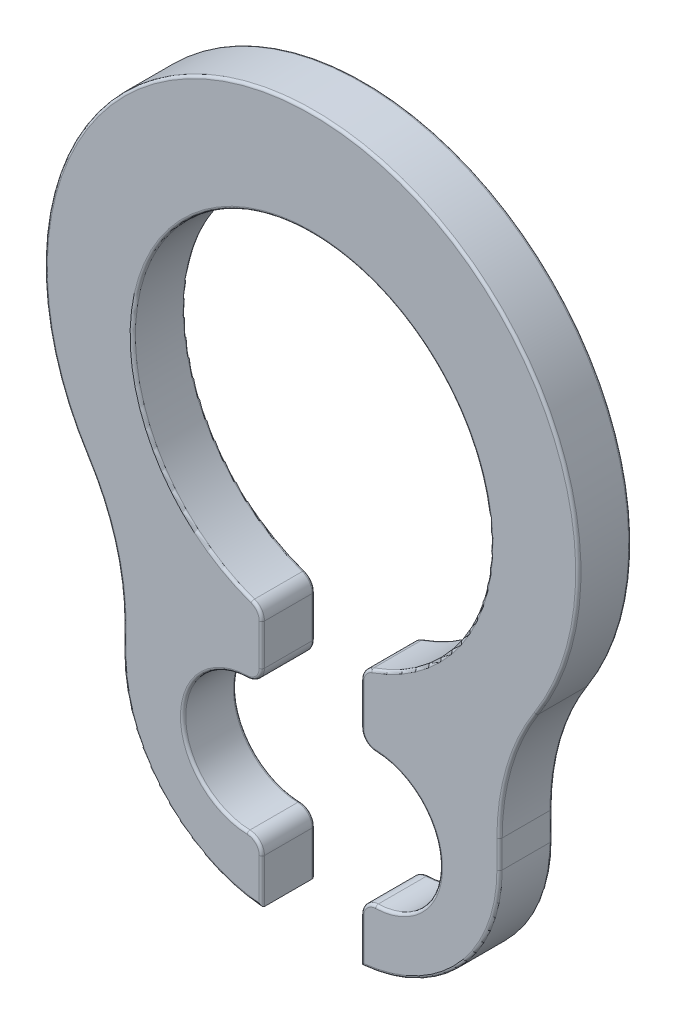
ISO-10303-21;
HEADER;
FILE_DESCRIPTION(('STEP AP214'),'2;1');
FILE_NAME('part.step','',(''),(''),'','','');
FILE_SCHEMA(('AUTOMOTIVE_DESIGN { 1 0 10303 214 1 1 1 1 }'));
ENDSEC;
DATA;
#1=APPLICATION_CONTEXT('core data for automotive mechanical design processes');
#2=APPLICATION_PROTOCOL_DEFINITION('international standard','automotive_design',2000,#1);
#3=PRODUCT_CONTEXT('',#1,'mechanical');
#4=PRODUCT('Part','Part','',(#3));
#5=PRODUCT_RELATED_PRODUCT_CATEGORY('part','',(#4));
#6=PRODUCT_DEFINITION_FORMATION('','',#4);
#7=PRODUCT_DEFINITION_CONTEXT('part definition',#1,'design');
#8=PRODUCT_DEFINITION('design','',#6,#7);
#9=PRODUCT_DEFINITION_SHAPE('','',#8);
#10=(LENGTH_UNIT() NAMED_UNIT(*) SI_UNIT(.MILLI.,.METRE.));
#11=(NAMED_UNIT(*) PLANE_ANGLE_UNIT() SI_UNIT($,.RADIAN.));
#12=(NAMED_UNIT(*) SI_UNIT($,.STERADIAN.) SOLID_ANGLE_UNIT());
#13=UNCERTAINTY_MEASURE_WITH_UNIT(LENGTH_MEASURE(1.E-05),#10,'distance_accuracy_value','');
#14=(GEOMETRIC_REPRESENTATION_CONTEXT(3) GLOBAL_UNCERTAINTY_ASSIGNED_CONTEXT((#13)) GLOBAL_UNIT_ASSIGNED_CONTEXT((#10,
#11,#12)) REPRESENTATION_CONTEXT('',''));
#15=CARTESIAN_POINT('',(0.,0.,0.));
#16=DIRECTION('',(0.,0.,1.));
#17=DIRECTION('',(1.,0.,0.));
#18=AXIS2_PLACEMENT_3D('',#15,#16,#17);
#19=CARTESIAN_POINT('',(0.28,-1.56,0.2));
#20=DIRECTION('',(0.,0.,-1.));
#21=DIRECTION('',(-1.,0.,0.));
#22=AXIS2_PLACEMENT_3D('',#19,#20,#21);
#23=CYLINDRICAL_SURFACE('',#22,1.14);
#24=DIRECTION('',(0.,0.,-1.));
#25=VECTOR('',#24,1.);
#26=CARTESIAN_POINT('',(0.375,-2.69603477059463,0.2));
#27=LINE('',#26,#25);
#28=CARTESIAN_POINT('',(0.375,-2.69603477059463,-0.18));
#29=VERTEX_POINT('',#28);
#30=CARTESIAN_POINT('',(0.375,-2.69603477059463,0.18));
#31=VERTEX_POINT('',#30);
#32=EDGE_CURVE('E303',#29,#31,#27,.F.);
#33=ORIENTED_EDGE('',*,*,#32,.F.);
#34=CARTESIAN_POINT('',(0.28,-1.56,-0.18));
#35=DIRECTION('',(0.,0.,-1.));
#36=DIRECTION('',(-1.,0.,0.));
#37=AXIS2_PLACEMENT_3D('',#34,#35,#36);
#38=CIRCLE('',#37,1.14);
#39=CARTESIAN_POINT('',(1.42,-1.56,-0.18));
#40=VERTEX_POINT('',#39);
#41=EDGE_CURVE('E318',#29,#40,#38,.F.);
#42=ORIENTED_EDGE('',*,*,#41,.T.);
#43=DIRECTION('',(0.,0.,-1.));
#44=VECTOR('',#43,1.);
#45=CARTESIAN_POINT('',(1.42,-1.56,0.2));
#46=LINE('',#45,#44);
#47=CARTESIAN_POINT('',(1.42,-1.56,0.18));
#48=VERTEX_POINT('',#47);
#49=EDGE_CURVE('E813',#48,#40,#46,.T.);
#50=ORIENTED_EDGE('',*,*,#49,.F.);
#51=CARTESIAN_POINT('',(0.28,-1.56,0.18));
#52=DIRECTION('',(0.,0.,-1.));
#53=DIRECTION('',(-1.,0.,0.));
#54=AXIS2_PLACEMENT_3D('',#51,#52,#53);
#55=CIRCLE('',#54,1.14);
#56=EDGE_CURVE('E321',#48,#31,#55,.T.);
#57=ORIENTED_EDGE('',*,*,#56,.T.);
#58=EDGE_LOOP('',(#33,#42,#50,#57));
#59=FACE_BOUND('',#58,.T.);
#60=ADVANCED_FACE('F37',(#59),#23,.T.);
#61=CARTESIAN_POINT('',(-3.1837172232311,-1.35034972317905,0.2));
#62=DIRECTION('',(0.,0.,-1.));
#63=DIRECTION('',(-1.,0.,0.));
#64=AXIS2_PLACEMENT_3D('',#61,#62,#63);
#65=PLANE('',#64);
#66=DIRECTION('',(0.,-1.,0.));
#67=VECTOR('',#66,1.);
#68=CARTESIAN_POINT('',(0.395,-1.13775005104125,0.2));
#69=LINE('',#68,#67);
#70=CARTESIAN_POINT('',(0.395,-0.828858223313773,0.2));
#71=VERTEX_POINT('',#70);
#72=CARTESIAN_POINT('',(0.395,-1.13775005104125,0.2));
#73=VERTEX_POINT('',#72);
#74=EDGE_CURVE('E51',#71,#73,#69,.T.);
#75=ORIENTED_EDGE('',*,*,#74,.T.);
#76=CARTESIAN_POINT('',(0.487500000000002,-1.13775005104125,0.2));
#77=DIRECTION('',(0.,0.,-1.));
#78=DIRECTION('',(-1.,0.,0.));
#79=AXIS2_PLACEMENT_3D('',#76,#77,#78);
#80=CIRCLE('',#79,0.0925000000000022);
#81=CARTESIAN_POINT('',(0.484857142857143,-1.23021228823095,0.2));
#82=VERTEX_POINT('',#81);
#83=EDGE_CURVE('E11',#73,#82,#80,.F.);
#84=ORIENTED_EDGE('',*,*,#83,.T.);
#85=CARTESIAN_POINT('',(0.46999999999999,-1.75000000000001,0.2));
#86=DIRECTION('',(0.,0.,-1.));
#87=DIRECTION('',(-1.,0.,0.));
#88=AXIS2_PLACEMENT_3D('',#85,#86,#87);
#89=CIRCLE('',#88,0.52);
#90=CARTESIAN_POINT('',(0.484857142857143,-2.26978771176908,0.2));
#91=VERTEX_POINT('',#90);
#92=EDGE_CURVE('E311',#82,#91,#89,.T.);
#93=ORIENTED_EDGE('',*,*,#92,.T.);
#94=CARTESIAN_POINT('',(0.487500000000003,-2.36224994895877,0.2));
#95=DIRECTION('',(0.,0.,-1.));
#96=DIRECTION('',(-1.,0.,0.));
#97=AXIS2_PLACEMENT_3D('',#94,#95,#96);
#98=CIRCLE('',#97,0.0925000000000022);
#99=CARTESIAN_POINT('',(0.395,-2.36224994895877,0.2));
#100=VERTEX_POINT('',#99);
#101=EDGE_CURVE('E457',#91,#100,#98,.F.);
#102=ORIENTED_EDGE('',*,*,#101,.T.);
#103=DIRECTION('',(0.,-1.,0.));
#104=VECTOR('',#103,1.);
#105=CARTESIAN_POINT('',(0.395,-2.69603477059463,0.2));
#106=LINE('',#105,#104);
#107=CARTESIAN_POINT('',(0.395,-2.67408033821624,0.2));
#108=VERTEX_POINT('',#107);
#109=EDGE_CURVE('E459',#100,#108,#106,.T.);
#110=ORIENTED_EDGE('',*,*,#109,.T.);
#111=CARTESIAN_POINT('',(0.28,-1.56,0.2));
#112=DIRECTION('',(0.,0.,-1.));
#113=DIRECTION('',(-1.,0.,0.));
#114=AXIS2_PLACEMENT_3D('',#111,#112,#113);
#115=CIRCLE('',#114,1.12);
#116=CARTESIAN_POINT('',(1.4,-1.56,0.2));
#117=VERTEX_POINT('',#116);
#118=EDGE_CURVE('E461',#108,#117,#115,.F.);
#119=ORIENTED_EDGE('',*,*,#118,.T.);
#120=DIRECTION('',(0.,1.,0.));
#121=VECTOR('',#120,1.);
#122=CARTESIAN_POINT('',(1.4,-1.35034972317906,0.2));
#123=LINE('',#122,#121);
#124=CARTESIAN_POINT('',(1.4,-1.35034972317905,0.2));
#125=VERTEX_POINT('',#124);
#126=EDGE_CURVE('E463',#117,#125,#123,.T.);
#127=ORIENTED_EDGE('',*,*,#126,.T.);
#128=CARTESIAN_POINT('',(3.1837172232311,-1.35034972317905,0.2));
#129=DIRECTION('',(0.,0.,-1.));
#130=DIRECTION('',(-1.,0.,0.));
#131=AXIS2_PLACEMENT_3D('',#128,#129,#130);
#132=CIRCLE('',#131,1.7837172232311);
#133=CARTESIAN_POINT('',(1.68086561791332,-0.389577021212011,0.2));
#134=VERTEX_POINT('',#133);
#135=EDGE_CURVE('E465',#125,#134,#132,.T.);
#136=ORIENTED_EDGE('',*,*,#135,.T.);
#137=CARTESIAN_POINT('',(0.,0.684999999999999,0.2));
#138=DIRECTION('',(0.,0.,-1.));
#139=DIRECTION('',(-1.,0.,0.));
#140=AXIS2_PLACEMENT_3D('',#137,#138,#139);
#141=CIRCLE('',#140,1.995);
#142=CARTESIAN_POINT('',(-1.68086561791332,-0.389577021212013,0.2));
#143=VERTEX_POINT('',#142);
#144=EDGE_CURVE('E467',#134,#143,#141,.F.);
#145=ORIENTED_EDGE('',*,*,#144,.T.);
#146=CARTESIAN_POINT('',(-3.1837172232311,-1.35034972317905,0.2));
#147=DIRECTION('',(0.,0.,-1.));
#148=DIRECTION('',(-1.,0.,0.));
#149=AXIS2_PLACEMENT_3D('',#146,#147,#148);
#150=CIRCLE('',#149,1.7837172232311);
#151=CARTESIAN_POINT('',(-1.4,-1.35034972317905,0.2));
#152=VERTEX_POINT('',#151);
#153=EDGE_CURVE('E469',#143,#152,#150,.T.);
#154=ORIENTED_EDGE('',*,*,#153,.T.);
#155=DIRECTION('',(0.,-1.,0.));
#156=VECTOR('',#155,1.);
#157=CARTESIAN_POINT('',(-1.4,-1.35034972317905,0.2));
#158=LINE('',#157,#156);
#159=CARTESIAN_POINT('',(-1.4,-1.56,0.2));
#160=VERTEX_POINT('',#159);
#161=EDGE_CURVE('E471',#152,#160,#158,.T.);
#162=ORIENTED_EDGE('',*,*,#161,.T.);
#163=CARTESIAN_POINT('',(-0.28,-1.56,0.2));
#164=DIRECTION('',(0.,0.,-1.));
#165=DIRECTION('',(-1.,0.,0.));
#166=AXIS2_PLACEMENT_3D('',#163,#164,#165);
#167=CIRCLE('',#166,1.12);
#168=CARTESIAN_POINT('',(-0.395,-2.67408033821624,0.2));
#169=VERTEX_POINT('',#168);
#170=EDGE_CURVE('E473',#160,#169,#167,.F.);
#171=ORIENTED_EDGE('',*,*,#170,.T.);
#172=DIRECTION('',(0.,-1.,0.));
#173=VECTOR('',#172,1.);
#174=CARTESIAN_POINT('',(-0.395,-1.35034972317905,0.2));
#175=LINE('',#174,#173);
#176=CARTESIAN_POINT('',(-0.395,-2.36224994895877,0.2));
#177=VERTEX_POINT('',#176);
#178=EDGE_CURVE('E475',#169,#177,#175,.F.);
#179=ORIENTED_EDGE('',*,*,#178,.T.);
#180=CARTESIAN_POINT('',(-0.487500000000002,-2.36224994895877,0.2));
#181=DIRECTION('',(0.,0.,-1.));
#182=DIRECTION('',(-1.,0.,0.));
#183=AXIS2_PLACEMENT_3D('',#180,#181,#182);
#184=CIRCLE('',#183,0.0925000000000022);
#185=CARTESIAN_POINT('',(-0.484857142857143,-2.26978771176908,0.2));
#186=VERTEX_POINT('',#185);
#187=EDGE_CURVE('E477',#177,#186,#184,.F.);
#188=ORIENTED_EDGE('',*,*,#187,.T.);
#189=CARTESIAN_POINT('',(-0.46999999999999,-1.75000000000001,0.2));
#190=DIRECTION('',(0.,0.,-1.));
#191=DIRECTION('',(-1.,0.,0.));
#192=AXIS2_PLACEMENT_3D('',#189,#190,#191);
#193=CIRCLE('',#192,0.52);
#194=CARTESIAN_POINT('',(-0.484857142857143,-1.23021228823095,0.2));
#195=VERTEX_POINT('',#194);
#196=EDGE_CURVE('E479',#186,#195,#193,.T.);
#197=ORIENTED_EDGE('',*,*,#196,.T.);
#198=CARTESIAN_POINT('',(-0.487500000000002,-1.13775005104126,0.2));
#199=DIRECTION('',(0.,0.,-1.));
#200=DIRECTION('',(-1.,0.,0.));
#201=AXIS2_PLACEMENT_3D('',#198,#199,#200);
#202=CIRCLE('',#201,0.0925000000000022);
#203=CARTESIAN_POINT('',(-0.395,-1.13775005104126,0.2));
#204=VERTEX_POINT('',#203);
#205=EDGE_CURVE('E481',#195,#204,#202,.F.);
#206=ORIENTED_EDGE('',*,*,#205,.T.);
#207=DIRECTION('',(0.,-1.,0.));
#208=VECTOR('',#207,1.);
#209=CARTESIAN_POINT('',(-0.395,-1.35034972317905,0.2));
#210=LINE('',#209,#208);
#211=CARTESIAN_POINT('',(-0.395,-0.828858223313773,0.2));
#212=VERTEX_POINT('',#211);
#213=EDGE_CURVE('E483',#204,#212,#210,.F.);
#214=ORIENTED_EDGE('',*,*,#213,.T.);
#215=CARTESIAN_POINT('',(-0.487500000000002,-0.828858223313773,0.2));
#216=DIRECTION('',(0.,0.,-1.));
#217=DIRECTION('',(-1.,0.,0.));
#218=AXIS2_PLACEMENT_3D('',#215,#216,#217);
#219=CIRCLE('',#218,0.0925000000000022);
#220=CARTESIAN_POINT('',(-0.456666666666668,-0.74164838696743,0.2));
#221=VERTEX_POINT('',#220);
#222=EDGE_CURVE('E485',#212,#221,#219,.F.);
#223=ORIENTED_EDGE('',*,*,#222,.T.);
#224=CARTESIAN_POINT('',(0.,0.549999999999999,0.2));
#225=DIRECTION('',(0.,0.,-1.));
#226=DIRECTION('',(-1.,0.,0.));
#227=AXIS2_PLACEMENT_3D('',#224,#225,#226);
#228=CIRCLE('',#227,1.37);
#229=CARTESIAN_POINT('',(0.456666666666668,-0.74164838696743,0.2));
#230=VERTEX_POINT('',#229);
#231=EDGE_CURVE('E487',#221,#230,#228,.T.);
#232=ORIENTED_EDGE('',*,*,#231,.T.);
#233=CARTESIAN_POINT('',(0.487500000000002,-0.828858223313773,0.2));
#234=DIRECTION('',(0.,0.,-1.));
#235=DIRECTION('',(-1.,0.,0.));
#236=AXIS2_PLACEMENT_3D('',#233,#234,#235);
#237=CIRCLE('',#236,0.0925000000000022);
#238=EDGE_CURVE('E62',#230,#71,#237,.F.);
#239=ORIENTED_EDGE('',*,*,#238,.T.);
#240=EDGE_LOOP('',(#75,#84,#93,#102,#110,#119,#127,#136,#145,#154,#162,#171,#179,#188,#197,#206,
#214,#223,#232,#239));
#241=FACE_BOUND('',#240,.T.);
#242=ADVANCED_FACE('F670',(#241),#65,.F.);
#243=CARTESIAN_POINT('',(-3.1837172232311,-1.35034972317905,-0.2));
#244=DIRECTION('',(0.,0.,-1.));
#245=DIRECTION('',(-1.,0.,0.));
#246=AXIS2_PLACEMENT_3D('',#243,#244,#245);
#247=PLANE('',#246);
#248=DIRECTION('',(0.,1.,0.));
#249=VECTOR('',#248,1.);
#250=CARTESIAN_POINT('',(1.4,-1.56,-0.2));
#251=LINE('',#250,#249);
#252=CARTESIAN_POINT('',(1.4,-1.35034972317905,-0.2));
#253=VERTEX_POINT('',#252);
#254=CARTESIAN_POINT('',(1.4,-1.56,-0.2));
#255=VERTEX_POINT('',#254);
#256=EDGE_CURVE('E378',#253,#255,#251,.F.);
#257=ORIENTED_EDGE('',*,*,#256,.T.);
#258=CARTESIAN_POINT('',(0.28,-1.56,-0.2));
#259=DIRECTION('',(0.,0.,-1.));
#260=DIRECTION('',(-1.,0.,0.));
#261=AXIS2_PLACEMENT_3D('',#258,#259,#260);
#262=CIRCLE('',#261,1.12);
#263=CARTESIAN_POINT('',(0.395,-2.67408033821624,-0.2));
#264=VERTEX_POINT('',#263);
#265=EDGE_CURVE('E380',#255,#264,#262,.T.);
#266=ORIENTED_EDGE('',*,*,#265,.T.);
#267=DIRECTION('',(0.,-1.,0.));
#268=VECTOR('',#267,1.);
#269=CARTESIAN_POINT('',(0.395,-1.35034972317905,-0.2));
#270=LINE('',#269,#268);
#271=CARTESIAN_POINT('',(0.395,-2.36224994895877,-0.2));
#272=VERTEX_POINT('',#271);
#273=EDGE_CURVE('E328',#264,#272,#270,.F.);
#274=ORIENTED_EDGE('',*,*,#273,.T.);
#275=CARTESIAN_POINT('',(0.487500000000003,-2.36224994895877,-0.2));
#276=DIRECTION('',(0.,0.,-1.));
#277=DIRECTION('',(-1.,0.,0.));
#278=AXIS2_PLACEMENT_3D('',#275,#276,#277);
#279=CIRCLE('',#278,0.0925000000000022);
#280=CARTESIAN_POINT('',(0.484857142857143,-2.26978771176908,-0.2));
#281=VERTEX_POINT('',#280);
#282=EDGE_CURVE('E339',#272,#281,#279,.T.);
#283=ORIENTED_EDGE('',*,*,#282,.T.);
#284=CARTESIAN_POINT('',(0.46999999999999,-1.75000000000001,-0.2));
#285=DIRECTION('',(0.,0.,-1.));
#286=DIRECTION('',(-1.,0.,0.));
#287=AXIS2_PLACEMENT_3D('',#284,#285,#286);
#288=CIRCLE('',#287,0.52);
#289=CARTESIAN_POINT('',(0.484857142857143,-1.23021228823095,-0.2));
#290=VERTEX_POINT('',#289);
#291=EDGE_CURVE('E346',#281,#290,#288,.F.);
#292=ORIENTED_EDGE('',*,*,#291,.T.);
#293=CARTESIAN_POINT('',(0.487500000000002,-1.13775005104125,-0.2));
#294=DIRECTION('',(0.,0.,-1.));
#295=DIRECTION('',(-1.,0.,0.));
#296=AXIS2_PLACEMENT_3D('',#293,#294,#295);
#297=CIRCLE('',#296,0.0925000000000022);
#298=CARTESIAN_POINT('',(0.395,-1.13775005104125,-0.2));
#299=VERTEX_POINT('',#298);
#300=EDGE_CURVE('E348',#290,#299,#297,.T.);
#301=ORIENTED_EDGE('',*,*,#300,.T.);
#302=DIRECTION('',(0.,-1.,0.));
#303=VECTOR('',#302,1.);
#304=CARTESIAN_POINT('',(0.395,-1.35034972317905,-0.2));
#305=LINE('',#304,#303);
#306=CARTESIAN_POINT('',(0.395,-0.828858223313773,-0.2));
#307=VERTEX_POINT('',#306);
#308=EDGE_CURVE('E350',#299,#307,#305,.F.);
#309=ORIENTED_EDGE('',*,*,#308,.T.);
#310=CARTESIAN_POINT('',(0.487500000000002,-0.828858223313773,-0.2));
#311=DIRECTION('',(0.,0.,-1.));
#312=DIRECTION('',(-1.,0.,0.));
#313=AXIS2_PLACEMENT_3D('',#310,#311,#312);
#314=CIRCLE('',#313,0.0925000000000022);
#315=CARTESIAN_POINT('',(0.456666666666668,-0.74164838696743,-0.2));
#316=VERTEX_POINT('',#315);
#317=EDGE_CURVE('E352',#307,#316,#314,.T.);
#318=ORIENTED_EDGE('',*,*,#317,.T.);
#319=CARTESIAN_POINT('',(0.,0.549999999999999,-0.2));
#320=DIRECTION('',(0.,0.,-1.));
#321=DIRECTION('',(-1.,0.,0.));
#322=AXIS2_PLACEMENT_3D('',#319,#320,#321);
#323=CIRCLE('',#322,1.37);
#324=CARTESIAN_POINT('',(-0.456666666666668,-0.74164838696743,-0.2));
#325=VERTEX_POINT('',#324);
#326=EDGE_CURVE('E354',#316,#325,#323,.F.);
#327=ORIENTED_EDGE('',*,*,#326,.T.);
#328=CARTESIAN_POINT('',(-0.487500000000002,-0.828858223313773,-0.2));
#329=DIRECTION('',(0.,0.,-1.));
#330=DIRECTION('',(-1.,0.,0.));
#331=AXIS2_PLACEMENT_3D('',#328,#329,#330);
#332=CIRCLE('',#331,0.0925000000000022);
#333=CARTESIAN_POINT('',(-0.395,-0.828858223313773,-0.2));
#334=VERTEX_POINT('',#333);
#335=EDGE_CURVE('E356',#325,#334,#332,.T.);
#336=ORIENTED_EDGE('',*,*,#335,.T.);
#337=DIRECTION('',(0.,-1.,0.));
#338=VECTOR('',#337,1.);
#339=CARTESIAN_POINT('',(-0.395,-1.13775005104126,-0.2));
#340=LINE('',#339,#338);
#341=CARTESIAN_POINT('',(-0.395,-1.13775005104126,-0.2));
#342=VERTEX_POINT('',#341);
#343=EDGE_CURVE('E358',#334,#342,#340,.T.);
#344=ORIENTED_EDGE('',*,*,#343,.T.);
#345=CARTESIAN_POINT('',(-0.487500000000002,-1.13775005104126,-0.2));
#346=DIRECTION('',(0.,0.,-1.));
#347=DIRECTION('',(-1.,0.,0.));
#348=AXIS2_PLACEMENT_3D('',#345,#346,#347);
#349=CIRCLE('',#348,0.0925000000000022);
#350=CARTESIAN_POINT('',(-0.484857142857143,-1.23021228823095,-0.2));
#351=VERTEX_POINT('',#350);
#352=EDGE_CURVE('E360',#342,#351,#349,.T.);
#353=ORIENTED_EDGE('',*,*,#352,.T.);
#354=CARTESIAN_POINT('',(-0.46999999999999,-1.75000000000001,-0.2));
#355=DIRECTION('',(0.,0.,-1.));
#356=DIRECTION('',(-1.,0.,0.));
#357=AXIS2_PLACEMENT_3D('',#354,#355,#356);
#358=CIRCLE('',#357,0.52);
#359=CARTESIAN_POINT('',(-0.484857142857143,-2.26978771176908,-0.2));
#360=VERTEX_POINT('',#359);
#361=EDGE_CURVE('E362',#351,#360,#358,.F.);
#362=ORIENTED_EDGE('',*,*,#361,.T.);
#363=CARTESIAN_POINT('',(-0.487500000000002,-2.36224994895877,-0.2));
#364=DIRECTION('',(0.,0.,-1.));
#365=DIRECTION('',(-1.,0.,0.));
#366=AXIS2_PLACEMENT_3D('',#363,#364,#365);
#367=CIRCLE('',#366,0.0925000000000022);
#368=CARTESIAN_POINT('',(-0.395,-2.36224994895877,-0.2));
#369=VERTEX_POINT('',#368);
#370=EDGE_CURVE('E364',#360,#369,#367,.T.);
#371=ORIENTED_EDGE('',*,*,#370,.T.);
#372=DIRECTION('',(0.,-1.,0.));
#373=VECTOR('',#372,1.);
#374=CARTESIAN_POINT('',(-0.395,-2.69603477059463,-0.2));
#375=LINE('',#374,#373);
#376=CARTESIAN_POINT('',(-0.395,-2.67408033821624,-0.2));
#377=VERTEX_POINT('',#376);
#378=EDGE_CURVE('E366',#369,#377,#375,.T.);
#379=ORIENTED_EDGE('',*,*,#378,.T.);
#380=CARTESIAN_POINT('',(-0.28,-1.56,-0.2));
#381=DIRECTION('',(0.,0.,-1.));
#382=DIRECTION('',(-1.,0.,0.));
#383=AXIS2_PLACEMENT_3D('',#380,#381,#382);
#384=CIRCLE('',#383,1.12);
#385=CARTESIAN_POINT('',(-1.4,-1.56,-0.2));
#386=VERTEX_POINT('',#385);
#387=EDGE_CURVE('E368',#377,#386,#384,.T.);
#388=ORIENTED_EDGE('',*,*,#387,.T.);
#389=DIRECTION('',(0.,-1.,0.));
#390=VECTOR('',#389,1.);
#391=CARTESIAN_POINT('',(-1.4,-1.35034972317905,-0.2));
#392=LINE('',#391,#390);
#393=CARTESIAN_POINT('',(-1.4,-1.35034972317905,-0.2));
#394=VERTEX_POINT('',#393);
#395=EDGE_CURVE('E370',#386,#394,#392,.F.);
#396=ORIENTED_EDGE('',*,*,#395,.T.);
#397=CARTESIAN_POINT('',(-3.1837172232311,-1.35034972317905,-0.2));
#398=DIRECTION('',(0.,0.,-1.));
#399=DIRECTION('',(-1.,0.,0.));
#400=AXIS2_PLACEMENT_3D('',#397,#398,#399);
#401=CIRCLE('',#400,1.7837172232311);
#402=CARTESIAN_POINT('',(-1.68086561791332,-0.389577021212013,-0.2));
#403=VERTEX_POINT('',#402);
#404=EDGE_CURVE('E372',#394,#403,#401,.F.);
#405=ORIENTED_EDGE('',*,*,#404,.T.);
#406=CARTESIAN_POINT('',(0.,0.684999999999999,-0.2));
#407=DIRECTION('',(0.,0.,-1.));
#408=DIRECTION('',(-1.,0.,0.));
#409=AXIS2_PLACEMENT_3D('',#406,#407,#408);
#410=CIRCLE('',#409,1.995);
#411=CARTESIAN_POINT('',(1.68086561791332,-0.389577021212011,-0.2));
#412=VERTEX_POINT('',#411);
#413=EDGE_CURVE('E374',#403,#412,#410,.T.);
#414=ORIENTED_EDGE('',*,*,#413,.T.);
#415=CARTESIAN_POINT('',(3.1837172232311,-1.35034972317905,-0.2));
#416=DIRECTION('',(0.,0.,-1.));
#417=DIRECTION('',(-1.,0.,0.));
#418=AXIS2_PLACEMENT_3D('',#415,#416,#417);
#419=CIRCLE('',#418,1.7837172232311);
#420=EDGE_CURVE('E376',#412,#253,#419,.F.);
#421=ORIENTED_EDGE('',*,*,#420,.T.);
#422=EDGE_LOOP('',(#257,#266,#274,#283,#292,#301,#309,#318,#327,#336,#344,#353,#362,#371,#379,
#388,#396,#405,#414,#421));
#423=FACE_BOUND('',#422,.T.);
#424=ADVANCED_FACE('F675',(#423),#247,.T.);
#425=CARTESIAN_POINT('',(-3.1837172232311,-1.35034972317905,0.2));
#426=DIRECTION('',(0.,0.,-1.));
#427=DIRECTION('',(-1.,0.,0.));
#428=AXIS2_PLACEMENT_3D('',#425,#426,#427);
#429=CYLINDRICAL_SURFACE('',#428,1.7637172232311);
#430=DIRECTION('',(0.,0.,-1.));
#431=VECTOR('',#430,1.);
#432=CARTESIAN_POINT('',(-1.69771640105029,-0.400349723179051,0.2));
#433=LINE('',#432,#431);
#434=CARTESIAN_POINT('',(-1.69771640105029,-0.400349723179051,0.18));
#435=VERTEX_POINT('',#434);
#436=CARTESIAN_POINT('',(-1.69771640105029,-0.400349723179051,-0.18));
#437=VERTEX_POINT('',#436);
#438=EDGE_CURVE('E821',#435,#437,#433,.T.);
#439=ORIENTED_EDGE('',*,*,#438,.T.);
#440=CARTESIAN_POINT('',(-3.1837172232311,-1.35034972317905,-0.18));
#441=DIRECTION('',(0.,0.,-1.));
#442=DIRECTION('',(-1.,0.,0.));
#443=AXIS2_PLACEMENT_3D('',#440,#441,#442);
#444=CIRCLE('',#443,1.7637172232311);
#445=CARTESIAN_POINT('',(-1.42,-1.35034972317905,-0.18));
#446=VERTEX_POINT('',#445);
#447=EDGE_CURVE('E396',#437,#446,#444,.T.);
#448=ORIENTED_EDGE('',*,*,#447,.T.);
#449=DIRECTION('',(0.,0.,-1.));
#450=VECTOR('',#449,1.);
#451=CARTESIAN_POINT('',(-1.42,-1.35034972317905,0.2));
#452=LINE('',#451,#450);
#453=CARTESIAN_POINT('',(-1.42,-1.35034972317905,0.18));
#454=VERTEX_POINT('',#453);
#455=EDGE_CURVE('E807',#454,#446,#452,.T.);
#456=ORIENTED_EDGE('',*,*,#455,.F.);
#457=CARTESIAN_POINT('',(-3.1837172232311,-1.35034972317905,0.18));
#458=DIRECTION('',(0.,0.,-1.));
#459=DIRECTION('',(-1.,0.,0.));
#460=AXIS2_PLACEMENT_3D('',#457,#458,#459);
#461=CIRCLE('',#460,1.7637172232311);
#462=EDGE_CURVE('E394',#454,#435,#461,.F.);
#463=ORIENTED_EDGE('',*,*,#462,.T.);
#464=EDGE_LOOP('',(#439,#448,#456,#463));
#465=FACE_BOUND('',#464,.T.);
#466=ADVANCED_FACE('F688',(#465),#429,.F.);
#467=CARTESIAN_POINT('',(-1.42,-1.35034972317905,0.2));
#468=DIRECTION('',(1.,0.,0.));
#469=DIRECTION('',(0.,0.,-1.));
#470=AXIS2_PLACEMENT_3D('',#467,#468,#469);
#471=PLANE('',#470);
#472=ORIENTED_EDGE('',*,*,#455,.T.);
#473=DIRECTION('',(0.,-1.,0.));
#474=VECTOR('',#473,1.);
#475=CARTESIAN_POINT('',(-1.42,-1.56,-0.18));
#476=LINE('',#475,#474);
#477=CARTESIAN_POINT('',(-1.42,-1.56,-0.18));
#478=VERTEX_POINT('',#477);
#479=EDGE_CURVE('E400',#446,#478,#476,.T.);
#480=ORIENTED_EDGE('',*,*,#479,.T.);
#481=DIRECTION('',(0.,0.,-1.));
#482=VECTOR('',#481,1.);
#483=CARTESIAN_POINT('',(-1.42,-1.56,0.2));
#484=LINE('',#483,#482);
#485=CARTESIAN_POINT('',(-1.42,-1.56,0.18));
#486=VERTEX_POINT('',#485);
#487=EDGE_CURVE('E810',#486,#478,#484,.T.);
#488=ORIENTED_EDGE('',*,*,#487,.F.);
#489=DIRECTION('',(0.,-1.,0.));
#490=VECTOR('',#489,1.);
#491=CARTESIAN_POINT('',(-1.42,-1.35034972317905,0.18));
#492=LINE('',#491,#490);
#493=EDGE_CURVE('E398',#486,#454,#492,.F.);
#494=ORIENTED_EDGE('',*,*,#493,.T.);
#495=EDGE_LOOP('',(#472,#480,#488,#494));
#496=FACE_BOUND('',#495,.T.);
#497=ADVANCED_FACE('F684',(#496),#471,.F.);
#498=CARTESIAN_POINT('',(-0.28,-1.56,0.2));
#499=DIRECTION('',(0.,0.,-1.));
#500=DIRECTION('',(-1.,0.,0.));
#501=AXIS2_PLACEMENT_3D('',#498,#499,#500);
#502=CYLINDRICAL_SURFACE('',#501,1.14);
#503=ORIENTED_EDGE('',*,*,#487,.T.);
#504=CARTESIAN_POINT('',(-0.28,-1.56,-0.18));
#505=DIRECTION('',(0.,0.,-1.));
#506=DIRECTION('',(-1.,0.,0.));
#507=AXIS2_PLACEMENT_3D('',#504,#505,#506);
#508=CIRCLE('',#507,1.14);
#509=CARTESIAN_POINT('',(-0.375,-2.69603477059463,-0.18));
#510=VERTEX_POINT('',#509);
#511=EDGE_CURVE('E404',#478,#510,#508,.F.);
#512=ORIENTED_EDGE('',*,*,#511,.T.);
#513=DIRECTION('',(0.,0.,-1.));
#514=VECTOR('',#513,1.);
#515=CARTESIAN_POINT('',(-0.375,-2.69603477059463,0.2));
#516=LINE('',#515,#514);
#517=CARTESIAN_POINT('',(-0.375,-2.69603477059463,0.18));
#518=VERTEX_POINT('',#517);
#519=EDGE_CURVE('E322',#510,#518,#516,.F.);
#520=ORIENTED_EDGE('',*,*,#519,.T.);
#521=CARTESIAN_POINT('',(-0.28,-1.56,0.18));
#522=DIRECTION('',(0.,0.,-1.));
#523=DIRECTION('',(-1.,0.,0.));
#524=AXIS2_PLACEMENT_3D('',#521,#522,#523);
#525=CIRCLE('',#524,1.14);
#526=EDGE_CURVE('E402',#518,#486,#525,.T.);
#527=ORIENTED_EDGE('',*,*,#526,.T.);
#528=EDGE_LOOP('',(#503,#512,#520,#527));
#529=FACE_BOUND('',#528,.T.);
#530=ADVANCED_FACE('F681',(#529),#502,.T.);
#531=CARTESIAN_POINT('',(1.42,-1.35034972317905,0.2));
#532=DIRECTION('',(-1.,0.,0.));
#533=DIRECTION('',(0.,-1.,0.));
#534=AXIS2_PLACEMENT_3D('',#531,#532,#533);
#535=PLANE('',#534);
#536=ORIENTED_EDGE('',*,*,#49,.T.);
#537=DIRECTION('',(0.,1.,0.));
#538=VECTOR('',#537,1.);
#539=CARTESIAN_POINT('',(1.42,-1.35034972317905,-0.18));
#540=LINE('',#539,#538);
#541=CARTESIAN_POINT('',(1.42,-1.35034972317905,-0.18));
#542=VERTEX_POINT('',#541);
#543=EDGE_CURVE('E384',#40,#542,#540,.T.);
#544=ORIENTED_EDGE('',*,*,#543,.T.);
#545=DIRECTION('',(0.,0.,-1.));
#546=VECTOR('',#545,1.);
#547=CARTESIAN_POINT('',(1.42,-1.35034972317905,0.2));
#548=LINE('',#547,#546);
#549=CARTESIAN_POINT('',(1.42,-1.35034972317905,0.18));
#550=VERTEX_POINT('',#549);
#551=EDGE_CURVE('E815',#550,#542,#548,.T.);
#552=ORIENTED_EDGE('',*,*,#551,.F.);
#553=DIRECTION('',(0.,1.,0.));
#554=VECTOR('',#553,1.);
#555=CARTESIAN_POINT('',(1.42,-1.35034972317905,0.18));
#556=LINE('',#555,#554);
#557=EDGE_CURVE('E382',#550,#48,#556,.F.);
#558=ORIENTED_EDGE('',*,*,#557,.T.);
#559=EDGE_LOOP('',(#536,#544,#552,#558));
#560=FACE_BOUND('',#559,.T.);
#561=ADVANCED_FACE('F679',(#560),#535,.F.);
#562=CARTESIAN_POINT('',(3.1837172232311,-1.35034972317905,0.2));
#563=DIRECTION('',(0.,0.,-1.));
#564=DIRECTION('',(-1.,0.,0.));
#565=AXIS2_PLACEMENT_3D('',#562,#563,#564);
#566=CYLINDRICAL_SURFACE('',#565,1.7637172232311);
#567=ORIENTED_EDGE('',*,*,#551,.T.);
#568=CARTESIAN_POINT('',(3.1837172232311,-1.35034972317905,-0.18));
#569=DIRECTION('',(0.,0.,-1.));
#570=DIRECTION('',(-1.,0.,0.));
#571=AXIS2_PLACEMENT_3D('',#568,#569,#570);
#572=CIRCLE('',#571,1.7637172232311);
#573=CARTESIAN_POINT('',(1.6977164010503,-0.400349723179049,-0.18));
#574=VERTEX_POINT('',#573);
#575=EDGE_CURVE('E388',#542,#574,#572,.T.);
#576=ORIENTED_EDGE('',*,*,#575,.T.);
#577=DIRECTION('',(0.,0.,-1.));
#578=VECTOR('',#577,1.);
#579=CARTESIAN_POINT('',(1.6977164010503,-0.400349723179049,0.2));
#580=LINE('',#579,#578);
#581=CARTESIAN_POINT('',(1.6977164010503,-0.400349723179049,0.18));
#582=VERTEX_POINT('',#581);
#583=EDGE_CURVE('E818',#582,#574,#580,.T.);
#584=ORIENTED_EDGE('',*,*,#583,.F.);
#585=CARTESIAN_POINT('',(3.1837172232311,-1.35034972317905,0.18));
#586=DIRECTION('',(0.,0.,-1.));
#587=DIRECTION('',(-1.,0.,0.));
#588=AXIS2_PLACEMENT_3D('',#585,#586,#587);
#589=CIRCLE('',#588,1.7637172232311);
#590=EDGE_CURVE('E386',#582,#550,#589,.F.);
#591=ORIENTED_EDGE('',*,*,#590,.T.);
#592=EDGE_LOOP('',(#567,#576,#584,#591));
#593=FACE_BOUND('',#592,.T.);
#594=ADVANCED_FACE('F993',(#593),#566,.F.);
#595=CARTESIAN_POINT('',(0.,0.684999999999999,0.2));
#596=DIRECTION('',(0.,0.,-1.));
#597=DIRECTION('',(-1.,0.,0.));
#598=AXIS2_PLACEMENT_3D('',#595,#596,#597);
#599=CYLINDRICAL_SURFACE('',#598,2.015);
#600=ORIENTED_EDGE('',*,*,#583,.T.);
#601=CARTESIAN_POINT('',(0.,0.684999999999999,-0.18));
#602=DIRECTION('',(0.,0.,-1.));
#603=DIRECTION('',(-1.,0.,0.));
#604=AXIS2_PLACEMENT_3D('',#601,#602,#603);
#605=CIRCLE('',#604,2.015);
#606=EDGE_CURVE('E392',#574,#437,#605,.F.);
#607=ORIENTED_EDGE('',*,*,#606,.T.);
#608=ORIENTED_EDGE('',*,*,#438,.F.);
#609=CARTESIAN_POINT('',(0.,0.684999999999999,0.18));
#610=DIRECTION('',(0.,0.,-1.));
#611=DIRECTION('',(-1.,0.,0.));
#612=AXIS2_PLACEMENT_3D('',#609,#610,#611);
#613=CIRCLE('',#612,2.015);
#614=EDGE_CURVE('E390',#435,#582,#613,.T.);
#615=ORIENTED_EDGE('',*,*,#614,.T.);
#616=EDGE_LOOP('',(#600,#607,#608,#615));
#617=FACE_BOUND('',#616,.T.);
#618=ADVANCED_FACE('F1010',(#617),#599,.T.);
#619=CARTESIAN_POINT('',(-0.46999999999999,-1.75000000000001,0.2));
#620=DIRECTION('',(0.,0.,-1.));
#621=DIRECTION('',(-1.,0.,0.));
#622=AXIS2_PLACEMENT_3D('',#619,#620,#621);
#623=CYLINDRICAL_SURFACE('',#622,0.5);
#624=DIRECTION('',(0.,0.,-1.));
#625=VECTOR('',#624,1.);
#626=CARTESIAN_POINT('',(-0.484285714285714,-2.24979587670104,0.2));
#627=LINE('',#626,#625);
#628=CARTESIAN_POINT('',(-0.484285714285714,-2.24979587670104,0.18));
#629=VERTEX_POINT('',#628);
#630=CARTESIAN_POINT('',(-0.484285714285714,-2.24979587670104,-0.18));
#631=VERTEX_POINT('',#630);
#632=EDGE_CURVE('E790',#629,#631,#627,.T.);
#633=ORIENTED_EDGE('',*,*,#632,.T.);
#634=CARTESIAN_POINT('',(-0.46999999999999,-1.75000000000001,-0.18));
#635=DIRECTION('',(0.,0.,-1.));
#636=DIRECTION('',(-1.,0.,0.));
#637=AXIS2_PLACEMENT_3D('',#634,#635,#636);
#638=CIRCLE('',#637,0.5);
#639=CARTESIAN_POINT('',(-0.484285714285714,-1.25020412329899,-0.18));
#640=VERTEX_POINT('',#639);
#641=EDGE_CURVE('E416',#631,#640,#638,.T.);
#642=ORIENTED_EDGE('',*,*,#641,.T.);
#643=DIRECTION('',(0.,0.,-1.));
#644=VECTOR('',#643,1.);
#645=CARTESIAN_POINT('',(-0.484285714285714,-1.25020412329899,0.2));
#646=LINE('',#645,#644);
#647=CARTESIAN_POINT('',(-0.484285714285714,-1.25020412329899,0.18));
#648=VERTEX_POINT('',#647);
#649=EDGE_CURVE('E795',#640,#648,#646,.F.);
#650=ORIENTED_EDGE('',*,*,#649,.T.);
#651=CARTESIAN_POINT('',(-0.46999999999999,-1.75000000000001,0.18));
#652=DIRECTION('',(0.,0.,-1.));
#653=DIRECTION('',(-1.,0.,0.));
#654=AXIS2_PLACEMENT_3D('',#651,#652,#653);
#655=CIRCLE('',#654,0.5);
#656=EDGE_CURVE('E414',#648,#629,#655,.F.);
#657=ORIENTED_EDGE('',*,*,#656,.T.);
#658=EDGE_LOOP('',(#633,#642,#650,#657));
#659=FACE_BOUND('',#658,.T.);
#660=ADVANCED_FACE('F885',(#659),#623,.F.);
#661=CARTESIAN_POINT('',(0.46999999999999,-1.75000000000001,0.2));
#662=DIRECTION('',(0.,0.,-1.));
#663=DIRECTION('',(-1.,0.,0.));
#664=AXIS2_PLACEMENT_3D('',#661,#662,#663);
#665=CYLINDRICAL_SURFACE('',#664,0.5);
#666=DIRECTION('',(0.,0.,-1.));
#667=VECTOR('',#666,1.);
#668=CARTESIAN_POINT('',(0.484285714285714,-1.25020412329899,0.2));
#669=LINE('',#668,#667);
#670=CARTESIAN_POINT('',(0.484285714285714,-1.25020412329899,0.18));
#671=VERTEX_POINT('',#670);
#672=CARTESIAN_POINT('',(0.484285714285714,-1.25020412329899,-0.18));
#673=VERTEX_POINT('',#672);
#674=EDGE_CURVE('E805',#671,#673,#669,.T.);
#675=ORIENTED_EDGE('',*,*,#674,.T.);
#676=CARTESIAN_POINT('',(0.46999999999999,-1.75000000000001,-0.18));
#677=DIRECTION('',(0.,0.,-1.));
#678=DIRECTION('',(-1.,0.,0.));
#679=AXIS2_PLACEMENT_3D('',#676,#677,#678);
#680=CIRCLE('',#679,0.5);
#681=CARTESIAN_POINT('',(0.484285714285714,-2.24979587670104,-0.18));
#682=VERTEX_POINT('',#681);
#683=EDGE_CURVE('E449',#673,#682,#680,.T.);
#684=ORIENTED_EDGE('',*,*,#683,.T.);
#685=DIRECTION('',(0.,0.,-1.));
#686=VECTOR('',#685,1.);
#687=CARTESIAN_POINT('',(0.484285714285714,-2.24979587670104,0.2));
#688=LINE('',#687,#686);
#689=CARTESIAN_POINT('',(0.484285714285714,-2.24979587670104,0.18));
#690=VERTEX_POINT('',#689);
#691=EDGE_CURVE('E802',#682,#690,#688,.F.);
#692=ORIENTED_EDGE('',*,*,#691,.T.);
#693=CARTESIAN_POINT('',(0.46999999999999,-1.75000000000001,0.18));
#694=DIRECTION('',(0.,0.,-1.));
#695=DIRECTION('',(-1.,0.,0.));
#696=AXIS2_PLACEMENT_3D('',#693,#694,#695);
#697=CIRCLE('',#696,0.5);
#698=EDGE_CURVE('E447',#690,#671,#697,.F.);
#699=ORIENTED_EDGE('',*,*,#698,.T.);
#700=EDGE_LOOP('',(#675,#684,#692,#699));
#701=FACE_BOUND('',#700,.T.);
#702=ADVANCED_FACE('F951',(#701),#665,.F.);
#703=CARTESIAN_POINT('',(0.,0.549999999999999,0.2));
#704=DIRECTION('',(0.,0.,-1.));
#705=DIRECTION('',(-1.,0.,0.));
#706=AXIS2_PLACEMENT_3D('',#703,#704,#705);
#707=CYLINDRICAL_SURFACE('',#706,1.35);
#708=DIRECTION('',(0.,0.,-1.));
#709=VECTOR('',#708,1.);
#710=CARTESIAN_POINT('',(-0.450000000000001,-0.722792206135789,0.2));
#711=LINE('',#710,#709);
#712=CARTESIAN_POINT('',(-0.450000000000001,-0.722792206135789,0.18));
#713=VERTEX_POINT('',#712);
#714=CARTESIAN_POINT('',(-0.450000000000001,-0.722792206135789,-0.18));
#715=VERTEX_POINT('',#714);
#716=EDGE_CURVE('E752',#713,#715,#711,.T.);
#717=ORIENTED_EDGE('',*,*,#716,.T.);
#718=CARTESIAN_POINT('',(0.,0.549999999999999,-0.18));
#719=DIRECTION('',(0.,0.,-1.));
#720=DIRECTION('',(-1.,0.,0.));
#721=AXIS2_PLACEMENT_3D('',#718,#719,#720);
#722=CIRCLE('',#721,1.35);
#723=CARTESIAN_POINT('',(0.450000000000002,-0.722792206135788,-0.18));
#724=VERTEX_POINT('',#723);
#725=EDGE_CURVE('E432',#715,#724,#722,.T.);
#726=ORIENTED_EDGE('',*,*,#725,.T.);
#727=DIRECTION('',(0.,0.,-1.));
#728=VECTOR('',#727,1.);
#729=CARTESIAN_POINT('',(0.450000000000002,-0.722792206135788,0.2));
#730=LINE('',#729,#728);
#731=CARTESIAN_POINT('',(0.450000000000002,-0.722792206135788,0.18));
#732=VERTEX_POINT('',#731);
#733=EDGE_CURVE('E733',#724,#732,#730,.F.);
#734=ORIENTED_EDGE('',*,*,#733,.T.);
#735=CARTESIAN_POINT('',(0.,0.549999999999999,0.18));
#736=DIRECTION('',(0.,0.,-1.));
#737=DIRECTION('',(-1.,0.,0.));
#738=AXIS2_PLACEMENT_3D('',#735,#736,#737);
#739=CIRCLE('',#738,1.35);
#740=EDGE_CURVE('E430',#732,#713,#739,.F.);
#741=ORIENTED_EDGE('',*,*,#740,.T.);
#742=EDGE_LOOP('',(#717,#726,#734,#741));
#743=FACE_BOUND('',#742,.T.);
#744=ADVANCED_FACE('F750',(#743),#707,.F.);
#745=CARTESIAN_POINT('',(0.375,0.549999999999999,-0.2));
#746=DIRECTION('',(-1.,0.,0.));
#747=DIRECTION('',(0.,-1.,0.));
#748=AXIS2_PLACEMENT_3D('',#745,#746,#747);
#749=PLANE('',#748);
#750=DIRECTION('',(0.,0.,-1.));
#751=VECTOR('',#750,1.);
#752=CARTESIAN_POINT('',(0.375,-0.828858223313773,-0.2));
#753=LINE('',#752,#751);
#754=CARTESIAN_POINT('',(0.375,-0.828858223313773,0.18));
#755=VERTEX_POINT('',#754);
#756=CARTESIAN_POINT('',(0.375,-0.828858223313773,-0.18));
#757=VERTEX_POINT('',#756);
#758=EDGE_CURVE('E786',#755,#757,#753,.T.);
#759=ORIENTED_EDGE('',*,*,#758,.T.);
#760=DIRECTION('',(0.,-1.,0.));
#761=VECTOR('',#760,1.);
#762=CARTESIAN_POINT('',(0.375,0.549999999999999,-0.18));
#763=LINE('',#762,#761);
#764=CARTESIAN_POINT('',(0.375,-1.13775005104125,-0.18));
#765=VERTEX_POINT('',#764);
#766=EDGE_CURVE('E440',#757,#765,#763,.T.);
#767=ORIENTED_EDGE('',*,*,#766,.T.);
#768=DIRECTION('',(0.,0.,-1.));
#769=VECTOR('',#768,1.);
#770=CARTESIAN_POINT('',(0.375,-1.13775005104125,-0.2));
#771=LINE('',#770,#769);
#772=CARTESIAN_POINT('',(0.375,-1.13775005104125,0.18));
#773=VERTEX_POINT('',#772);
#774=EDGE_CURVE('E757',#765,#773,#771,.F.);
#775=ORIENTED_EDGE('',*,*,#774,.T.);
#776=DIRECTION('',(0.,-1.,0.));
#777=VECTOR('',#776,1.);
#778=CARTESIAN_POINT('',(0.375,-0.828858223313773,0.18));
#779=LINE('',#778,#777);
#780=EDGE_CURVE('E438',#773,#755,#779,.F.);
#781=ORIENTED_EDGE('',*,*,#780,.T.);
#782=EDGE_LOOP('',(#759,#767,#775,#781));
#783=FACE_BOUND('',#782,.T.);
#784=ADVANCED_FACE('F785',(#783),#749,.T.);
#785=CARTESIAN_POINT('',(-0.375,0.549999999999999,-0.2));
#786=DIRECTION('',(-1.,0.,0.));
#787=DIRECTION('',(0.,-1.,0.));
#788=AXIS2_PLACEMENT_3D('',#785,#786,#787);
#789=PLANE('',#788);
#790=DIRECTION('',(0.,0.,1.));
#791=VECTOR('',#790,1.);
#792=CARTESIAN_POINT('',(-0.375,-1.13775005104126,-0.2));
#793=LINE('',#792,#791);
#794=CARTESIAN_POINT('',(-0.375,-1.13775005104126,0.18));
#795=VERTEX_POINT('',#794);
#796=CARTESIAN_POINT('',(-0.375,-1.13775005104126,-0.18));
#797=VERTEX_POINT('',#796);
#798=EDGE_CURVE('E341',#795,#797,#793,.F.);
#799=ORIENTED_EDGE('',*,*,#798,.T.);
#800=DIRECTION('',(0.,-1.,0.));
#801=VECTOR('',#800,1.);
#802=CARTESIAN_POINT('',(-0.375,-0.828858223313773,-0.18));
#803=LINE('',#802,#801);
#804=CARTESIAN_POINT('',(-0.375,-0.828858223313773,-0.18));
#805=VERTEX_POINT('',#804);
#806=EDGE_CURVE('E424',#797,#805,#803,.F.);
#807=ORIENTED_EDGE('',*,*,#806,.T.);
#808=DIRECTION('',(0.,0.,1.));
#809=VECTOR('',#808,1.);
#810=CARTESIAN_POINT('',(-0.375,-0.828858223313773,0.2));
#811=LINE('',#810,#809);
#812=CARTESIAN_POINT('',(-0.375,-0.828858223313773,0.18));
#813=VERTEX_POINT('',#812);
#814=EDGE_CURVE('E725',#805,#813,#811,.T.);
#815=ORIENTED_EDGE('',*,*,#814,.T.);
#816=DIRECTION('',(0.,-1.,0.));
#817=VECTOR('',#816,1.);
#818=CARTESIAN_POINT('',(-0.375,0.549999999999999,0.18));
#819=LINE('',#818,#817);
#820=EDGE_CURVE('E422',#813,#795,#819,.T.);
#821=ORIENTED_EDGE('',*,*,#820,.T.);
#822=EDGE_LOOP('',(#799,#807,#815,#821));
#823=FACE_BOUND('',#822,.T.);
#824=ADVANCED_FACE('F763',(#823),#789,.F.);
#825=DIRECTION('',(0.,0.,-1.));
#826=VECTOR('',#825,1.);
#827=CARTESIAN_POINT('',(0.375,-2.36224994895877,-0.2));
#828=LINE('',#827,#826);
#829=CARTESIAN_POINT('',(0.375,-2.36224994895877,0.18));
#830=VERTEX_POINT('',#829);
#831=CARTESIAN_POINT('',(0.375,-2.36224994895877,-0.18));
#832=VERTEX_POINT('',#831);
#833=EDGE_CURVE('E306',#830,#832,#828,.T.);
#834=ORIENTED_EDGE('',*,*,#833,.T.);
#835=DIRECTION('',(0.,-1.,0.));
#836=VECTOR('',#835,1.);
#837=CARTESIAN_POINT('',(0.375,0.549999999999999,-0.18));
#838=LINE('',#837,#836);
#839=EDGE_CURVE('E300',#832,#29,#838,.T.);
#840=ORIENTED_EDGE('',*,*,#839,.T.);
#841=ORIENTED_EDGE('',*,*,#32,.T.);
#842=DIRECTION('',(0.,-1.,0.));
#843=VECTOR('',#842,1.);
#844=CARTESIAN_POINT('',(0.375,-2.36224994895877,0.18));
#845=LINE('',#844,#843);
#846=EDGE_CURVE('E312',#31,#830,#845,.F.);
#847=ORIENTED_EDGE('',*,*,#846,.T.);
#848=EDGE_LOOP('',(#834,#840,#841,#847));
#849=FACE_BOUND('',#848,.T.);
#850=ADVANCED_FACE('F302',(#849),#749,.T.);
#851=ORIENTED_EDGE('',*,*,#519,.F.);
#852=DIRECTION('',(0.,-1.,0.));
#853=VECTOR('',#852,1.);
#854=CARTESIAN_POINT('',(-0.375,-2.36224994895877,-0.18));
#855=LINE('',#854,#853);
#856=CARTESIAN_POINT('',(-0.375,-2.36224994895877,-0.18));
#857=VERTEX_POINT('',#856);
#858=EDGE_CURVE('E408',#510,#857,#855,.F.);
#859=ORIENTED_EDGE('',*,*,#858,.T.);
#860=DIRECTION('',(0.,0.,1.));
#861=VECTOR('',#860,1.);
#862=CARTESIAN_POINT('',(-0.375,-2.36224994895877,0.2));
#863=LINE('',#862,#861);
#864=CARTESIAN_POINT('',(-0.375,-2.36224994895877,0.18));
#865=VERTEX_POINT('',#864);
#866=EDGE_CURVE('E798',#857,#865,#863,.T.);
#867=ORIENTED_EDGE('',*,*,#866,.T.);
#868=DIRECTION('',(0.,-1.,0.));
#869=VECTOR('',#868,1.);
#870=CARTESIAN_POINT('',(-0.375,0.549999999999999,0.18));
#871=LINE('',#870,#869);
#872=EDGE_CURVE('E406',#865,#518,#871,.T.);
#873=ORIENTED_EDGE('',*,*,#872,.T.);
#874=EDGE_LOOP('',(#851,#859,#867,#873));
#875=FACE_BOUND('',#874,.T.);
#876=ADVANCED_FACE('F697',(#875),#789,.F.);
#877=CARTESIAN_POINT('',(0.487500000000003,-2.36224994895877,0.2));
#878=DIRECTION('',(0.,0.,-1.));
#879=DIRECTION('',(-1.,0.,0.));
#880=AXIS2_PLACEMENT_3D('',#877,#878,#879);
#881=CYLINDRICAL_SURFACE('',#880,0.112500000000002);
#882=ORIENTED_EDGE('',*,*,#691,.F.);
#883=CARTESIAN_POINT('',(0.487500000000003,-2.36224994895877,-0.18));
#884=DIRECTION('',(0.,0.,-1.));
#885=DIRECTION('',(-1.,0.,0.));
#886=AXIS2_PLACEMENT_3D('',#883,#884,#885);
#887=CIRCLE('',#886,0.112500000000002);
#888=EDGE_CURVE('E453',#682,#832,#887,.F.);
#889=ORIENTED_EDGE('',*,*,#888,.T.);
#890=ORIENTED_EDGE('',*,*,#833,.F.);
#891=CARTESIAN_POINT('',(0.487500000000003,-2.36224994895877,0.18));
#892=DIRECTION('',(0.,0.,-1.));
#893=DIRECTION('',(-1.,0.,0.));
#894=AXIS2_PLACEMENT_3D('',#891,#892,#893);
#895=CIRCLE('',#894,0.112500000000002);
#896=EDGE_CURVE('E451',#830,#690,#895,.T.);
#897=ORIENTED_EDGE('',*,*,#896,.T.);
#898=EDGE_LOOP('',(#882,#889,#890,#897));
#899=FACE_BOUND('',#898,.T.);
#900=ADVANCED_FACE('F693',(#899),#881,.T.);
#901=CARTESIAN_POINT('',(-0.487500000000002,-2.36224994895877,0.2));
#902=DIRECTION('',(0.,0.,-1.));
#903=DIRECTION('',(-1.,0.,0.));
#904=AXIS2_PLACEMENT_3D('',#901,#902,#903);
#905=CYLINDRICAL_SURFACE('',#904,0.112500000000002);
#906=ORIENTED_EDGE('',*,*,#866,.F.);
#907=CARTESIAN_POINT('',(-0.487500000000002,-2.36224994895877,-0.18));
#908=DIRECTION('',(0.,0.,-1.));
#909=DIRECTION('',(-1.,0.,0.));
#910=AXIS2_PLACEMENT_3D('',#907,#908,#909);
#911=CIRCLE('',#910,0.112500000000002);
#912=EDGE_CURVE('E412',#857,#631,#911,.F.);
#913=ORIENTED_EDGE('',*,*,#912,.T.);
#914=ORIENTED_EDGE('',*,*,#632,.F.);
#915=CARTESIAN_POINT('',(-0.487500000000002,-2.36224994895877,0.18));
#916=DIRECTION('',(0.,0.,-1.));
#917=DIRECTION('',(-1.,0.,0.));
#918=AXIS2_PLACEMENT_3D('',#915,#916,#917);
#919=CIRCLE('',#918,0.112500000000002);
#920=EDGE_CURVE('E410',#629,#865,#919,.T.);
#921=ORIENTED_EDGE('',*,*,#920,.T.);
#922=EDGE_LOOP('',(#906,#913,#914,#921));
#923=FACE_BOUND('',#922,.T.);
#924=ADVANCED_FACE('F696',(#923),#905,.T.);
#925=CARTESIAN_POINT('',(0.487500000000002,-1.13775005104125,0.2));
#926=DIRECTION('',(0.,0.,-1.));
#927=DIRECTION('',(-1.,0.,0.));
#928=AXIS2_PLACEMENT_3D('',#925,#926,#927);
#929=CYLINDRICAL_SURFACE('',#928,0.112500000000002);
#930=ORIENTED_EDGE('',*,*,#774,.F.);
#931=CARTESIAN_POINT('',(0.487500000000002,-1.13775005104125,-0.18));
#932=DIRECTION('',(0.,0.,-1.));
#933=DIRECTION('',(-1.,0.,0.));
#934=AXIS2_PLACEMENT_3D('',#931,#932,#933);
#935=CIRCLE('',#934,0.112500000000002);
#936=EDGE_CURVE('E445',#765,#673,#935,.F.);
#937=ORIENTED_EDGE('',*,*,#936,.T.);
#938=ORIENTED_EDGE('',*,*,#674,.F.);
#939=CARTESIAN_POINT('',(0.487500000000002,-1.13775005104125,0.18));
#940=DIRECTION('',(0.,0.,-1.));
#941=DIRECTION('',(-1.,0.,0.));
#942=AXIS2_PLACEMENT_3D('',#939,#940,#941);
#943=CIRCLE('',#942,0.112500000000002);
#944=EDGE_CURVE('E442',#671,#773,#943,.T.);
#945=ORIENTED_EDGE('',*,*,#944,.T.);
#946=EDGE_LOOP('',(#930,#937,#938,#945));
#947=FACE_BOUND('',#946,.T.);
#948=ADVANCED_FACE('F701',(#947),#929,.T.);
#949=CARTESIAN_POINT('',(0.487500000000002,-0.828858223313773,0.2));
#950=DIRECTION('',(0.,0.,-1.));
#951=DIRECTION('',(-1.,0.,0.));
#952=AXIS2_PLACEMENT_3D('',#949,#950,#951);
#953=CYLINDRICAL_SURFACE('',#952,0.112500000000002);
#954=ORIENTED_EDGE('',*,*,#733,.F.);
#955=CARTESIAN_POINT('',(0.487500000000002,-0.828858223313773,-0.18));
#956=DIRECTION('',(0.,0.,-1.));
#957=DIRECTION('',(-1.,0.,0.));
#958=AXIS2_PLACEMENT_3D('',#955,#956,#957);
#959=CIRCLE('',#958,0.112500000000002);
#960=EDGE_CURVE('E436',#724,#757,#959,.F.);
#961=ORIENTED_EDGE('',*,*,#960,.T.);
#962=ORIENTED_EDGE('',*,*,#758,.F.);
#963=CARTESIAN_POINT('',(0.487500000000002,-0.828858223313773,0.18));
#964=DIRECTION('',(0.,0.,-1.));
#965=DIRECTION('',(-1.,0.,0.));
#966=AXIS2_PLACEMENT_3D('',#963,#964,#965);
#967=CIRCLE('',#966,0.112500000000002);
#968=EDGE_CURVE('E434',#755,#732,#967,.T.);
#969=ORIENTED_EDGE('',*,*,#968,.T.);
#970=EDGE_LOOP('',(#954,#961,#962,#969));
#971=FACE_BOUND('',#970,.T.);
#972=ADVANCED_FACE('F705',(#971),#953,.T.);
#973=CARTESIAN_POINT('',(-0.487500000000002,-1.13775005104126,0.2));
#974=DIRECTION('',(0.,0.,-1.));
#975=DIRECTION('',(-1.,0.,0.));
#976=AXIS2_PLACEMENT_3D('',#973,#974,#975);
#977=CYLINDRICAL_SURFACE('',#976,0.112500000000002);
#978=ORIENTED_EDGE('',*,*,#649,.F.);
#979=CARTESIAN_POINT('',(-0.487500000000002,-1.13775005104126,-0.18));
#980=DIRECTION('',(0.,0.,-1.));
#981=DIRECTION('',(-1.,0.,0.));
#982=AXIS2_PLACEMENT_3D('',#979,#980,#981);
#983=CIRCLE('',#982,0.112500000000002);
#984=EDGE_CURVE('E420',#640,#797,#983,.F.);
#985=ORIENTED_EDGE('',*,*,#984,.T.);
#986=ORIENTED_EDGE('',*,*,#798,.F.);
#987=CARTESIAN_POINT('',(-0.487500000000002,-1.13775005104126,0.18));
#988=DIRECTION('',(0.,0.,-1.));
#989=DIRECTION('',(-1.,0.,0.));
#990=AXIS2_PLACEMENT_3D('',#987,#988,#989);
#991=CIRCLE('',#990,0.112500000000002);
#992=EDGE_CURVE('E418',#795,#648,#991,.T.);
#993=ORIENTED_EDGE('',*,*,#992,.T.);
#994=EDGE_LOOP('',(#978,#985,#986,#993));
#995=FACE_BOUND('',#994,.T.);
#996=ADVANCED_FACE('F709',(#995),#977,.T.);
#997=CARTESIAN_POINT('',(-0.487500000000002,-0.828858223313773,0.2));
#998=DIRECTION('',(0.,0.,-1.));
#999=DIRECTION('',(-1.,0.,0.));
#1000=AXIS2_PLACEMENT_3D('',#997,#998,#999);
#1001=CYLINDRICAL_SURFACE('',#1000,0.112500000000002);
#1002=ORIENTED_EDGE('',*,*,#814,.F.);
#1003=CARTESIAN_POINT('',(-0.487500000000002,-0.828858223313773,-0.18));
#1004=DIRECTION('',(0.,0.,-1.));
#1005=DIRECTION('',(-1.,0.,0.));
#1006=AXIS2_PLACEMENT_3D('',#1003,#1004,#1005);
#1007=CIRCLE('',#1006,0.112500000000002);
#1008=EDGE_CURVE('E428',#805,#715,#1007,.F.);
#1009=ORIENTED_EDGE('',*,*,#1008,.T.);
#1010=ORIENTED_EDGE('',*,*,#716,.F.);
#1011=CARTESIAN_POINT('',(-0.487500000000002,-0.828858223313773,0.18));
#1012=DIRECTION('',(0.,0.,-1.));
#1013=DIRECTION('',(-1.,0.,0.));
#1014=AXIS2_PLACEMENT_3D('',#1011,#1012,#1013);
#1015=CIRCLE('',#1014,0.112500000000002);
#1016=EDGE_CURVE('E426',#713,#813,#1015,.T.);
#1017=ORIENTED_EDGE('',*,*,#1016,.T.);
#1018=EDGE_LOOP('',(#1002,#1009,#1010,#1017));
#1019=FACE_BOUND('',#1018,.T.);
#1020=ADVANCED_FACE('F712',(#1019),#1001,.T.);
#1021=CARTESIAN_POINT('',(-0.487500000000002,-1.13775005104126,-0.18));
#1022=DIRECTION('',(0.,0.,-1.));
#1023=DIRECTION('',(-1.,0.,0.));
#1024=AXIS2_PLACEMENT_3D('',#1021,#1022,#1023);
#1025=TOROIDAL_SURFACE('',#1024,0.0925000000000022,0.02);
#1026=CARTESIAN_POINT('',(-0.484857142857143,-1.23021228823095,-0.18));
#1027=DIRECTION('',(-0.999591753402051,-0.0285714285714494,0.));
#1028=DIRECTION('',(0.0285714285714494,-0.999591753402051,0.));
#1029=AXIS2_PLACEMENT_3D('',#1026,#1027,#1028);
#1030=CIRCLE('',#1029,0.02);
#1031=EDGE_CURVE('E576',#351,#640,#1030,.T.);
#1032=ORIENTED_EDGE('',*,*,#1031,.F.);
#1033=ORIENTED_EDGE('',*,*,#352,.F.);
#1034=CARTESIAN_POINT('',(-0.395,-1.13775005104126,-0.18));
#1035=DIRECTION('',(0.,1.,0.));
#1036=DIRECTION('',(0.,0.,1.));
#1037=AXIS2_PLACEMENT_3D('',#1034,#1035,#1036);
#1038=CIRCLE('',#1037,0.02);
#1039=EDGE_CURVE('E323',#797,#342,#1038,.T.);
#1040=ORIENTED_EDGE('',*,*,#1039,.F.);
#1041=ORIENTED_EDGE('',*,*,#984,.F.);
#1042=EDGE_LOOP('',(#1032,#1033,#1040,#1041));
#1043=FACE_BOUND('',#1042,.T.);
#1044=ADVANCED_FACE('F715',(#1043),#1025,.T.);
#1045=CARTESIAN_POINT('',(-0.395,-1.35034972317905,-0.18));
#1046=DIRECTION('',(0.,1.,0.));
#1047=DIRECTION('',(-1.,0.,0.));
#1048=AXIS2_PLACEMENT_3D('',#1045,#1046,#1047);
#1049=CYLINDRICAL_SURFACE('',#1048,0.02);
#1050=ORIENTED_EDGE('',*,*,#1039,.T.);
#1051=ORIENTED_EDGE('',*,*,#343,.F.);
#1052=CARTESIAN_POINT('',(-0.395,-0.828858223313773,-0.18));
#1053=DIRECTION('',(0.,1.,0.));
#1054=DIRECTION('',(0.,0.,1.));
#1055=AXIS2_PLACEMENT_3D('',#1052,#1053,#1054);
#1056=CIRCLE('',#1055,0.02);
#1057=EDGE_CURVE('E573',#805,#334,#1056,.T.);
#1058=ORIENTED_EDGE('',*,*,#1057,.F.);
#1059=ORIENTED_EDGE('',*,*,#806,.F.);
#1060=EDGE_LOOP('',(#1050,#1051,#1058,#1059));
#1061=FACE_BOUND('',#1060,.T.);
#1062=ADVANCED_FACE('F720',(#1061),#1049,.T.);
#1063=CARTESIAN_POINT('',(-0.46999999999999,-1.75000000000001,-0.18));
#1064=DIRECTION('',(0.,0.,-1.));
#1065=DIRECTION('',(-1.,0.,0.));
#1066=AXIS2_PLACEMENT_3D('',#1063,#1064,#1065);
#1067=TOROIDAL_SURFACE('',#1066,0.52,0.02);
#1068=ORIENTED_EDGE('',*,*,#1031,.T.);
#1069=ORIENTED_EDGE('',*,*,#641,.F.);
#1070=CARTESIAN_POINT('',(-0.484857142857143,-2.26978771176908,-0.18));
#1071=DIRECTION('',(0.999591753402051,-0.0285714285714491,0.));
#1072=DIRECTION('',(0.0285714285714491,0.999591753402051,0.));
#1073=AXIS2_PLACEMENT_3D('',#1070,#1071,#1072);
#1074=CIRCLE('',#1073,0.02);
#1075=EDGE_CURVE('E570',#360,#631,#1074,.T.);
#1076=ORIENTED_EDGE('',*,*,#1075,.F.);
#1077=ORIENTED_EDGE('',*,*,#361,.F.);
#1078=EDGE_LOOP('',(#1068,#1069,#1076,#1077));
#1079=FACE_BOUND('',#1078,.T.);
#1080=ADVANCED_FACE('F907',(#1079),#1067,.T.);
#1081=CARTESIAN_POINT('',(-0.487500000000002,-0.828858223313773,-0.18));
#1082=DIRECTION('',(0.,0.,-1.));
#1083=DIRECTION('',(-1.,0.,0.));
#1084=AXIS2_PLACEMENT_3D('',#1081,#1082,#1083);
#1085=TOROIDAL_SURFACE('',#1084,0.0925000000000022,0.02);
#1086=ORIENTED_EDGE('',*,*,#1057,.T.);
#1087=ORIENTED_EDGE('',*,*,#335,.F.);
#1088=CARTESIAN_POINT('',(-0.456666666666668,-0.74164838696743,-0.18));
#1089=DIRECTION('',(-0.942809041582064,0.333333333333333,0.));
#1090=DIRECTION('',(-0.333333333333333,-0.942809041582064,0.));
#1091=AXIS2_PLACEMENT_3D('',#1088,#1089,#1090);
#1092=CIRCLE('',#1091,0.02);
#1093=EDGE_CURVE('E567',#715,#325,#1092,.T.);
#1094=ORIENTED_EDGE('',*,*,#1093,.F.);
#1095=ORIENTED_EDGE('',*,*,#1008,.F.);
#1096=EDGE_LOOP('',(#1086,#1087,#1094,#1095));
#1097=FACE_BOUND('',#1096,.T.);
#1098=ADVANCED_FACE('F741',(#1097),#1085,.T.);
#1099=CARTESIAN_POINT('',(-0.487500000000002,-2.36224994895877,-0.18));
#1100=DIRECTION('',(0.,0.,-1.));
#1101=DIRECTION('',(-1.,0.,0.));
#1102=AXIS2_PLACEMENT_3D('',#1099,#1100,#1101);
#1103=TOROIDAL_SURFACE('',#1102,0.0925000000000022,0.02);
#1104=ORIENTED_EDGE('',*,*,#1075,.T.);
#1105=ORIENTED_EDGE('',*,*,#912,.F.);
#1106=CARTESIAN_POINT('',(-0.395,-2.36224994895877,-0.18));
#1107=DIRECTION('',(0.,-1.,0.));
#1108=DIRECTION('',(0.,0.,-1.));
#1109=AXIS2_PLACEMENT_3D('',#1106,#1107,#1108);
#1110=CIRCLE('',#1109,0.02);
#1111=EDGE_CURVE('E564',#369,#857,#1110,.T.);
#1112=ORIENTED_EDGE('',*,*,#1111,.F.);
#1113=ORIENTED_EDGE('',*,*,#370,.F.);
#1114=EDGE_LOOP('',(#1104,#1105,#1112,#1113));
#1115=FACE_BOUND('',#1114,.T.);
#1116=ADVANCED_FACE('F905',(#1115),#1103,.T.);
#1117=CARTESIAN_POINT('',(0.,0.549999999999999,-0.18));
#1118=DIRECTION('',(0.,0.,-1.));
#1119=DIRECTION('',(-1.,0.,0.));
#1120=AXIS2_PLACEMENT_3D('',#1117,#1118,#1119);
#1121=TOROIDAL_SURFACE('',#1120,1.37,0.02);
#1122=ORIENTED_EDGE('',*,*,#1093,.T.);
#1123=ORIENTED_EDGE('',*,*,#326,.F.);
#1124=CARTESIAN_POINT('',(0.456666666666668,-0.74164838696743,-0.18));
#1125=DIRECTION('',(-0.942809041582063,-0.333333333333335,0.));
#1126=DIRECTION('',(0.333333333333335,-0.942809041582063,0.));
#1127=AXIS2_PLACEMENT_3D('',#1124,#1125,#1126);
#1128=CIRCLE('',#1127,0.02);
#1129=EDGE_CURVE('E559',#724,#316,#1128,.T.);
#1130=ORIENTED_EDGE('',*,*,#1129,.F.);
#1131=ORIENTED_EDGE('',*,*,#725,.F.);
#1132=EDGE_LOOP('',(#1122,#1123,#1130,#1131));
#1133=FACE_BOUND('',#1132,.T.);
#1134=ADVANCED_FACE('F546',(#1133),#1121,.T.);
#1135=CARTESIAN_POINT('',(-0.395,-1.35034972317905,-0.18));
#1136=DIRECTION('',(0.,1.,0.));
#1137=DIRECTION('',(-1.,0.,0.));
#1138=AXIS2_PLACEMENT_3D('',#1135,#1136,#1137);
#1139=CYLINDRICAL_SURFACE('',#1138,0.02);
#1140=ORIENTED_EDGE('',*,*,#1111,.T.);
#1141=ORIENTED_EDGE('',*,*,#858,.F.);
#1142=CARTESIAN_POINT('',(-0.375,-2.69603477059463,-0.18));
#1143=CARTESIAN_POINT('',(-0.37499846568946,-2.69603642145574,-0.180875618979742));
#1144=CARTESIAN_POINT('',(-0.375057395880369,-2.69597237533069,-0.181748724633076));
#1145=CARTESIAN_POINT('',(-0.375282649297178,-2.69572746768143,-0.183455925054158));
#1146=CARTESIAN_POINT('',(-0.375447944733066,-2.69554772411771,-0.184290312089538));
#1147=CARTESIAN_POINT('',(-0.375872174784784,-2.69508624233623,-0.185901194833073));
#1148=CARTESIAN_POINT('',(-0.376130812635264,-2.69480482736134,-0.186677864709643));
#1149=CARTESIAN_POINT('',(-0.376725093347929,-2.69415789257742,-0.188165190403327));
#1150=CARTESIAN_POINT('',(-0.377060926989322,-2.69379216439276,-0.188875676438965));
#1151=CARTESIAN_POINT('',(-0.377956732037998,-2.69281604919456,-0.190524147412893));
#1152=CARTESIAN_POINT('',(-0.378549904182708,-2.69216925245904,-0.191422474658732));
#1153=CARTESIAN_POINT('',(-0.379824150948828,-2.6907784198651,-0.193068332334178));
#1154=CARTESIAN_POINT('',(-0.380505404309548,-2.69003418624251,-0.193815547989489));
#1155=CARTESIAN_POINT('',(-0.382245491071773,-2.68813115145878,-0.195470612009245));
#1156=CARTESIAN_POINT('',(-0.383337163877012,-2.68693554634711,-0.196301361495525));
#1157=CARTESIAN_POINT('',(-0.385591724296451,-2.68446208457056,-0.197698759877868));
#1158=CARTESIAN_POINT('',(-0.386754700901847,-2.68318412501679,-0.198265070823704));
#1159=CARTESIAN_POINT('',(-0.388994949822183,-2.68071799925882,-0.199110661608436));
#1160=CARTESIAN_POINT('',(-0.390068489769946,-2.6795343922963,-0.199413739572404));
#1161=CARTESIAN_POINT('',(-0.392227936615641,-2.67714968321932,-0.199837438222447));
#1162=CARTESIAN_POINT('',(-0.393313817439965,-2.6759486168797,-0.199958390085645));
#1163=CARTESIAN_POINT('',(-0.394599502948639,-2.67452423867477,-0.199996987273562));
#1164=CARTESIAN_POINT('',(-0.394799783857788,-2.67430228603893,-0.199999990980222));
#1165=CARTESIAN_POINT('',(-0.395,-2.67408033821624,-0.2));
#1166=B_SPLINE_CURVE_WITH_KNOTS('',3,(#1142,#1143,#1144,#1145,#1146,#1147,#1148,#1149,#1150,
#1151,#1152,#1153,#1154,#1155,#1156,#1157,#1158,#1159,#1160,#1161,#1162,#1163,#1164,#1165),
.UNSPECIFIED.,.F.,.F.,(4,2,2,2,2,2,2,2,2,2,2,4),(0.,0.00261855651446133,0.00521218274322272,
0.00779763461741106,0.0103895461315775,0.014136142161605,0.0178904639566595,0.0233200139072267,
0.0287564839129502,0.0336252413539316,0.0384851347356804,0.0393819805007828),.UNSPECIFIED.);
#1167=EDGE_CURVE('E551',#377,#510,#1166,.F.);
#1168=ORIENTED_EDGE('',*,*,#1167,.F.);
#1169=ORIENTED_EDGE('',*,*,#378,.F.);
#1170=EDGE_LOOP('',(#1140,#1141,#1168,#1169));
#1171=FACE_BOUND('',#1170,.T.);
#1172=ADVANCED_FACE('F541',(#1171),#1139,.T.);
#1173=CARTESIAN_POINT('',(0.487500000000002,-0.828858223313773,-0.18));
#1174=DIRECTION('',(0.,0.,-1.));
#1175=DIRECTION('',(-1.,0.,0.));
#1176=AXIS2_PLACEMENT_3D('',#1173,#1174,#1175);
#1177=TOROIDAL_SURFACE('',#1176,0.0925000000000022,0.02);
#1178=ORIENTED_EDGE('',*,*,#1129,.T.);
#1179=ORIENTED_EDGE('',*,*,#317,.F.);
#1180=CARTESIAN_POINT('',(0.395,-0.828858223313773,-0.18));
#1181=DIRECTION('',(0.,-1.,0.));
#1182=DIRECTION('',(0.,0.,-1.));
#1183=AXIS2_PLACEMENT_3D('',#1180,#1181,#1182);
#1184=CIRCLE('',#1183,0.02);
#1185=EDGE_CURVE('E560',#757,#307,#1184,.T.);
#1186=ORIENTED_EDGE('',*,*,#1185,.F.);
#1187=ORIENTED_EDGE('',*,*,#960,.F.);
#1188=EDGE_LOOP('',(#1178,#1179,#1186,#1187));
#1189=FACE_BOUND('',#1188,.T.);
#1190=ADVANCED_FACE('F545',(#1189),#1177,.T.);
#1191=CARTESIAN_POINT('',(-0.28,-1.56,-0.18));
#1192=DIRECTION('',(0.,0.,-1.));
#1193=DIRECTION('',(-1.,0.,0.));
#1194=AXIS2_PLACEMENT_3D('',#1191,#1192,#1193);
#1195=TOROIDAL_SURFACE('',#1194,1.12,0.02);
#1196=ORIENTED_EDGE('',*,*,#1167,.T.);
#1197=ORIENTED_EDGE('',*,*,#511,.F.);
#1198=CARTESIAN_POINT('',(-1.4,-1.56,-0.18));
#1199=DIRECTION('',(0.,1.,0.));
#1200=DIRECTION('',(0.,0.,1.));
#1201=AXIS2_PLACEMENT_3D('',#1198,#1199,#1200);
#1202=CIRCLE('',#1201,0.02);
#1203=EDGE_CURVE('E777',#386,#478,#1202,.T.);
#1204=ORIENTED_EDGE('',*,*,#1203,.F.);
#1205=ORIENTED_EDGE('',*,*,#387,.F.);
#1206=EDGE_LOOP('',(#1196,#1197,#1204,#1205));
#1207=FACE_BOUND('',#1206,.T.);
#1208=ADVANCED_FACE('F539',(#1207),#1195,.T.);
#1209=CARTESIAN_POINT('',(0.395,0.549999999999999,-0.18));
#1210=DIRECTION('',(0.,-1.,0.));
#1211=DIRECTION('',(1.,0.,0.));
#1212=AXIS2_PLACEMENT_3D('',#1209,#1210,#1211);
#1213=CYLINDRICAL_SURFACE('',#1212,0.02);
#1214=ORIENTED_EDGE('',*,*,#1185,.T.);
#1215=ORIENTED_EDGE('',*,*,#308,.F.);
#1216=CARTESIAN_POINT('',(0.395,-1.13775005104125,-0.18));
#1217=DIRECTION('',(0.,-1.,0.));
#1218=DIRECTION('',(0.,0.,-1.));
#1219=AXIS2_PLACEMENT_3D('',#1216,#1217,#1218);
#1220=CIRCLE('',#1219,0.02);
#1221=EDGE_CURVE('E780',#765,#299,#1220,.T.);
#1222=ORIENTED_EDGE('',*,*,#1221,.F.);
#1223=ORIENTED_EDGE('',*,*,#766,.F.);
#1224=EDGE_LOOP('',(#1214,#1215,#1222,#1223));
#1225=FACE_BOUND('',#1224,.T.);
#1226=ADVANCED_FACE('F535',(#1225),#1213,.T.);
#1227=CARTESIAN_POINT('',(-1.4,-1.35034972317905,-0.18));
#1228=DIRECTION('',(0.,1.,0.));
#1229=DIRECTION('',(0.,0.,1.));
#1230=AXIS2_PLACEMENT_3D('',#1227,#1228,#1229);
#1231=CYLINDRICAL_SURFACE('',#1230,0.02);
#1232=ORIENTED_EDGE('',*,*,#1203,.T.);
#1233=ORIENTED_EDGE('',*,*,#479,.F.);
#1234=CARTESIAN_POINT('',(-1.4,-1.35034972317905,-0.18));
#1235=DIRECTION('',(0.,1.,0.));
#1236=DIRECTION('',(0.,0.,1.));
#1237=AXIS2_PLACEMENT_3D('',#1234,#1235,#1236);
#1238=CIRCLE('',#1237,0.02);
#1239=EDGE_CURVE('E974',#394,#446,#1238,.T.);
#1240=ORIENTED_EDGE('',*,*,#1239,.F.);
#1241=ORIENTED_EDGE('',*,*,#395,.F.);
#1242=EDGE_LOOP('',(#1232,#1233,#1240,#1241));
#1243=FACE_BOUND('',#1242,.T.);
#1244=ADVANCED_FACE('F531',(#1243),#1231,.T.);
#1245=CARTESIAN_POINT('',(0.487500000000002,-1.13775005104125,-0.18));
#1246=DIRECTION('',(0.,0.,-1.));
#1247=DIRECTION('',(-1.,0.,0.));
#1248=AXIS2_PLACEMENT_3D('',#1245,#1246,#1247);
#1249=TOROIDAL_SURFACE('',#1248,0.0925000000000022,0.02);
#1250=ORIENTED_EDGE('',*,*,#1221,.T.);
#1251=ORIENTED_EDGE('',*,*,#300,.F.);
#1252=CARTESIAN_POINT('',(0.484857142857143,-1.23021228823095,-0.18));
#1253=DIRECTION('',(0.999591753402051,-0.0285714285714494,0.));
#1254=DIRECTION('',(0.0285714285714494,0.999591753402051,0.));
#1255=AXIS2_PLACEMENT_3D('',#1252,#1253,#1254);
#1256=CIRCLE('',#1255,0.02);
#1257=EDGE_CURVE('E972',#673,#290,#1256,.T.);
#1258=ORIENTED_EDGE('',*,*,#1257,.F.);
#1259=ORIENTED_EDGE('',*,*,#936,.F.);
#1260=EDGE_LOOP('',(#1250,#1251,#1258,#1259));
#1261=FACE_BOUND('',#1260,.T.);
#1262=ADVANCED_FACE('F527',(#1261),#1249,.T.);
#1263=CARTESIAN_POINT('',(-3.1837172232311,-1.35034972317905,-0.18));
#1264=DIRECTION('',(0.,0.,-1.));
#1265=DIRECTION('',(-1.,0.,0.));
#1266=AXIS2_PLACEMENT_3D('',#1263,#1264,#1265);
#1267=TOROIDAL_SURFACE('',#1266,1.7837172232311,0.02);
#1268=ORIENTED_EDGE('',*,*,#1239,.T.);
#1269=ORIENTED_EDGE('',*,*,#447,.F.);
#1270=CARTESIAN_POINT('',(-1.68086561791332,-0.389577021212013,-0.18));
#1271=DIRECTION('',(-0.538635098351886,0.84253915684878,0.));
#1272=DIRECTION('',(-0.84253915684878,-0.538635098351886,0.));
#1273=AXIS2_PLACEMENT_3D('',#1270,#1271,#1272);
#1274=CIRCLE('',#1273,0.02);
#1275=EDGE_CURVE('E962',#403,#437,#1274,.T.);
#1276=ORIENTED_EDGE('',*,*,#1275,.F.);
#1277=ORIENTED_EDGE('',*,*,#404,.F.);
#1278=EDGE_LOOP('',(#1268,#1269,#1276,#1277));
#1279=FACE_BOUND('',#1278,.T.);
#1280=ADVANCED_FACE('F523',(#1279),#1267,.T.);
#1281=CARTESIAN_POINT('',(0.46999999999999,-1.75000000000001,-0.18));
#1282=DIRECTION('',(0.,0.,-1.));
#1283=DIRECTION('',(-1.,0.,0.));
#1284=AXIS2_PLACEMENT_3D('',#1281,#1282,#1283);
#1285=TOROIDAL_SURFACE('',#1284,0.52,0.02);
#1286=ORIENTED_EDGE('',*,*,#1257,.T.);
#1287=ORIENTED_EDGE('',*,*,#291,.F.);
#1288=CARTESIAN_POINT('',(0.484857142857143,-2.26978771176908,-0.18));
#1289=DIRECTION('',(-0.999591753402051,-0.0285714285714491,0.));
#1290=DIRECTION('',(0.0285714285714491,-0.999591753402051,0.));
#1291=AXIS2_PLACEMENT_3D('',#1288,#1289,#1290);
#1292=CIRCLE('',#1291,0.02);
#1293=EDGE_CURVE('E959',#682,#281,#1292,.T.);
#1294=ORIENTED_EDGE('',*,*,#1293,.F.);
#1295=ORIENTED_EDGE('',*,*,#683,.F.);
#1296=EDGE_LOOP('',(#1286,#1287,#1294,#1295));
#1297=FACE_BOUND('',#1296,.T.);
#1298=ADVANCED_FACE('F519',(#1297),#1285,.T.);
#1299=CARTESIAN_POINT('',(0.,0.684999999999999,-0.18));
#1300=DIRECTION('',(0.,0.,-1.));
#1301=DIRECTION('',(-1.,0.,0.));
#1302=AXIS2_PLACEMENT_3D('',#1299,#1300,#1301);
#1303=TOROIDAL_SURFACE('',#1302,1.995,0.02);
#1304=ORIENTED_EDGE('',*,*,#1275,.T.);
#1305=ORIENTED_EDGE('',*,*,#606,.F.);
#1306=CARTESIAN_POINT('',(1.68086561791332,-0.389577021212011,-0.18));
#1307=DIRECTION('',(-0.538635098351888,-0.842539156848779,0.));
#1308=DIRECTION('',(0.842539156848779,-0.538635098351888,0.));
#1309=AXIS2_PLACEMENT_3D('',#1306,#1307,#1308);
#1310=CIRCLE('',#1309,0.02);
#1311=EDGE_CURVE('E963',#412,#574,#1310,.T.);
#1312=ORIENTED_EDGE('',*,*,#1311,.F.);
#1313=ORIENTED_EDGE('',*,*,#413,.F.);
#1314=EDGE_LOOP('',(#1304,#1305,#1312,#1313));
#1315=FACE_BOUND('',#1314,.T.);
#1316=ADVANCED_FACE('F515',(#1315),#1303,.T.);
#1317=CARTESIAN_POINT('',(0.487500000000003,-2.36224994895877,-0.18));
#1318=DIRECTION('',(0.,0.,-1.));
#1319=DIRECTION('',(-1.,0.,0.));
#1320=AXIS2_PLACEMENT_3D('',#1317,#1318,#1319);
#1321=TOROIDAL_SURFACE('',#1320,0.0925000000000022,0.02);
#1322=ORIENTED_EDGE('',*,*,#1293,.T.);
#1323=ORIENTED_EDGE('',*,*,#282,.F.);
#1324=CARTESIAN_POINT('',(0.395,-2.36224994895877,-0.18));
#1325=DIRECTION('',(0.,-1.,0.));
#1326=DIRECTION('',(0.,0.,-1.));
#1327=AXIS2_PLACEMENT_3D('',#1324,#1325,#1326);
#1328=CIRCLE('',#1327,0.02);
#1329=EDGE_CURVE('E965',#832,#272,#1328,.T.);
#1330=ORIENTED_EDGE('',*,*,#1329,.F.);
#1331=ORIENTED_EDGE('',*,*,#888,.F.);
#1332=EDGE_LOOP('',(#1322,#1323,#1330,#1331));
#1333=FACE_BOUND('',#1332,.T.);
#1334=ADVANCED_FACE('F511',(#1333),#1321,.T.);
#1335=CARTESIAN_POINT('',(3.1837172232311,-1.35034972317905,-0.18));
#1336=DIRECTION('',(0.,0.,-1.));
#1337=DIRECTION('',(-1.,0.,0.));
#1338=AXIS2_PLACEMENT_3D('',#1335,#1336,#1337);
#1339=TOROIDAL_SURFACE('',#1338,1.7837172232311,0.02);
#1340=ORIENTED_EDGE('',*,*,#1311,.T.);
#1341=ORIENTED_EDGE('',*,*,#575,.F.);
#1342=CARTESIAN_POINT('',(1.4,-1.35034972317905,-0.18));
#1343=DIRECTION('',(0.,-1.,0.));
#1344=DIRECTION('',(0.,0.,-1.));
#1345=AXIS2_PLACEMENT_3D('',#1342,#1343,#1344);
#1346=CIRCLE('',#1345,0.02);
#1347=EDGE_CURVE('E332',#253,#542,#1346,.T.);
#1348=ORIENTED_EDGE('',*,*,#1347,.F.);
#1349=ORIENTED_EDGE('',*,*,#420,.F.);
#1350=EDGE_LOOP('',(#1340,#1341,#1348,#1349));
#1351=FACE_BOUND('',#1350,.T.);
#1352=ADVANCED_FACE('F505',(#1351),#1339,.T.);
#1353=CARTESIAN_POINT('',(0.395,0.549999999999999,-0.18));
#1354=DIRECTION('',(0.,-1.,0.));
#1355=DIRECTION('',(1.,0.,0.));
#1356=AXIS2_PLACEMENT_3D('',#1353,#1354,#1355);
#1357=CYLINDRICAL_SURFACE('',#1356,0.02);
#1358=ORIENTED_EDGE('',*,*,#1329,.T.);
#1359=ORIENTED_EDGE('',*,*,#273,.F.);
#1360=CARTESIAN_POINT('',(0.375,-2.69603477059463,-0.18));
#1361=CARTESIAN_POINT('',(0.37499846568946,-2.69603642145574,-0.180875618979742));
#1362=CARTESIAN_POINT('',(0.375057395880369,-2.69597237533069,-0.181748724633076));
#1363=CARTESIAN_POINT('',(0.375282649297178,-2.69572746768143,-0.183455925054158));
#1364=CARTESIAN_POINT('',(0.375447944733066,-2.69554772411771,-0.184290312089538));
#1365=CARTESIAN_POINT('',(0.375872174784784,-2.69508624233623,-0.185901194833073));
#1366=CARTESIAN_POINT('',(0.376130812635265,-2.69480482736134,-0.186677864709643));
#1367=CARTESIAN_POINT('',(0.376725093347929,-2.69415789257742,-0.188165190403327));
#1368=CARTESIAN_POINT('',(0.377060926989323,-2.69379216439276,-0.188875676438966));
#1369=CARTESIAN_POINT('',(0.377956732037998,-2.69281604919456,-0.190524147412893));
#1370=CARTESIAN_POINT('',(0.378549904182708,-2.69216925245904,-0.191422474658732));
#1371=CARTESIAN_POINT('',(0.379824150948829,-2.6907784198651,-0.193068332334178));
#1372=CARTESIAN_POINT('',(0.380505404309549,-2.69003418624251,-0.193815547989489));
#1373=CARTESIAN_POINT('',(0.382245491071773,-2.68813115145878,-0.195470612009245));
#1374=CARTESIAN_POINT('',(0.383337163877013,-2.68693554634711,-0.196301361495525));
#1375=CARTESIAN_POINT('',(0.385591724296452,-2.68446208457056,-0.197698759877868));
#1376=CARTESIAN_POINT('',(0.386754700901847,-2.68318412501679,-0.198265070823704));
#1377=CARTESIAN_POINT('',(0.388994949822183,-2.68071799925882,-0.199110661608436));
#1378=CARTESIAN_POINT('',(0.390068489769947,-2.6795343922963,-0.199413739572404));
#1379=CARTESIAN_POINT('',(0.392227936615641,-2.67714968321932,-0.199837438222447));
#1380=CARTESIAN_POINT('',(0.393313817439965,-2.67594861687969,-0.199958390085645));
#1381=CARTESIAN_POINT('',(0.394599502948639,-2.67452423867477,-0.199996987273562));
#1382=CARTESIAN_POINT('',(0.394799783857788,-2.67430228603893,-0.199999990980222));
#1383=CARTESIAN_POINT('',(0.395,-2.67408033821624,-0.2));
#1384=B_SPLINE_CURVE_WITH_KNOTS('',3,(#1360,#1361,#1362,#1363,#1364,#1365,#1366,#1367,#1368,
#1369,#1370,#1371,#1372,#1373,#1374,#1375,#1376,#1377,#1378,#1379,#1380,#1381,#1382,#1383),
.UNSPECIFIED.,.F.,.F.,(4,2,2,2,2,2,2,2,2,2,2,4),(0.,0.00261855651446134,0.0052121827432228,
0.00779763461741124,0.0103895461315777,0.0141361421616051,0.0178904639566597,0.023320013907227,
0.0287564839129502,0.0336252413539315,0.0384851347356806,0.0393819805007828),.UNSPECIFIED.);
#1385=EDGE_CURVE('E326',#29,#264,#1384,.T.);
#1386=ORIENTED_EDGE('',*,*,#1385,.F.);
#1387=ORIENTED_EDGE('',*,*,#839,.F.);
#1388=EDGE_LOOP('',(#1358,#1359,#1386,#1387));
#1389=FACE_BOUND('',#1388,.T.);
#1390=ADVANCED_FACE('F327',(#1389),#1357,.T.);
#1391=CARTESIAN_POINT('',(1.4,-1.35034972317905,-0.18));
#1392=DIRECTION('',(0.,-1.,0.));
#1393=DIRECTION('',(1.,0.,0.));
#1394=AXIS2_PLACEMENT_3D('',#1391,#1392,#1393);
#1395=CYLINDRICAL_SURFACE('',#1394,0.02);
#1396=ORIENTED_EDGE('',*,*,#1347,.T.);
#1397=ORIENTED_EDGE('',*,*,#543,.F.);
#1398=CARTESIAN_POINT('',(1.4,-1.56,-0.18));
#1399=DIRECTION('',(0.,-1.,0.));
#1400=DIRECTION('',(0.,0.,-1.));
#1401=AXIS2_PLACEMENT_3D('',#1398,#1399,#1400);
#1402=CIRCLE('',#1401,0.02);
#1403=EDGE_CURVE('E333',#255,#40,#1402,.T.);
#1404=ORIENTED_EDGE('',*,*,#1403,.F.);
#1405=ORIENTED_EDGE('',*,*,#256,.F.);
#1406=EDGE_LOOP('',(#1396,#1397,#1404,#1405));
#1407=FACE_BOUND('',#1406,.T.);
#1408=ADVANCED_FACE('F504',(#1407),#1395,.T.);
#1409=CARTESIAN_POINT('',(0.28,-1.56,-0.18));
#1410=DIRECTION('',(0.,0.,-1.));
#1411=DIRECTION('',(-1.,0.,0.));
#1412=AXIS2_PLACEMENT_3D('',#1409,#1410,#1411);
#1413=TOROIDAL_SURFACE('',#1412,1.12,0.02);
#1414=ORIENTED_EDGE('',*,*,#1385,.T.);
#1415=ORIENTED_EDGE('',*,*,#265,.F.);
#1416=ORIENTED_EDGE('',*,*,#1403,.T.);
#1417=ORIENTED_EDGE('',*,*,#41,.F.);
#1418=EDGE_LOOP('',(#1414,#1415,#1416,#1417));
#1419=FACE_BOUND('',#1418,.T.);
#1420=ADVANCED_FACE('F335',(#1419),#1413,.T.);
#1421=CARTESIAN_POINT('',(-0.28,-1.56,0.18));
#1422=DIRECTION('',(0.,0.,-1.));
#1423=DIRECTION('',(-1.,0.,0.));
#1424=AXIS2_PLACEMENT_3D('',#1421,#1422,#1423);
#1425=TOROIDAL_SURFACE('',#1424,1.12,0.02);
#1426=CARTESIAN_POINT('',(-1.4,-1.56,0.18));
#1427=DIRECTION('',(0.,1.,0.));
#1428=DIRECTION('',(0.,0.,1.));
#1429=AXIS2_PLACEMENT_3D('',#1426,#1427,#1428);
#1430=CIRCLE('',#1429,0.02);
#1431=EDGE_CURVE('E836',#486,#160,#1430,.T.);
#1432=ORIENTED_EDGE('',*,*,#1431,.F.);
#1433=ORIENTED_EDGE('',*,*,#526,.F.);
#1434=CARTESIAN_POINT('',(-0.375,-2.69603477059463,0.18));
#1435=CARTESIAN_POINT('',(-0.374998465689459,-2.69603642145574,0.180875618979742));
#1436=CARTESIAN_POINT('',(-0.375057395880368,-2.69597237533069,0.181748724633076));
#1437=CARTESIAN_POINT('',(-0.375282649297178,-2.69572746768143,0.183455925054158));
#1438=CARTESIAN_POINT('',(-0.375447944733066,-2.69554772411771,0.184290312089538));
#1439=CARTESIAN_POINT('',(-0.375872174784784,-2.69508624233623,0.185901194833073));
#1440=CARTESIAN_POINT('',(-0.376130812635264,-2.69480482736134,0.186677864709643));
#1441=CARTESIAN_POINT('',(-0.376725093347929,-2.69415789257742,0.188165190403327));
#1442=CARTESIAN_POINT('',(-0.377060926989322,-2.69379216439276,0.188875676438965));
#1443=CARTESIAN_POINT('',(-0.377956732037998,-2.69281604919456,0.190524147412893));
#1444=CARTESIAN_POINT('',(-0.378549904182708,-2.69216925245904,0.191422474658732));
#1445=CARTESIAN_POINT('',(-0.379824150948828,-2.6907784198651,0.193068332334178));
#1446=CARTESIAN_POINT('',(-0.380505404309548,-2.69003418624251,0.193815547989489));
#1447=CARTESIAN_POINT('',(-0.382245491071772,-2.68813115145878,0.195470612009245));
#1448=CARTESIAN_POINT('',(-0.383337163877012,-2.68693554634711,0.196301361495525));
#1449=CARTESIAN_POINT('',(-0.385591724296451,-2.68446208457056,0.197698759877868));
#1450=CARTESIAN_POINT('',(-0.386754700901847,-2.68318412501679,0.198265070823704));
#1451=CARTESIAN_POINT('',(-0.388994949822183,-2.68071799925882,0.199110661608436));
#1452=CARTESIAN_POINT('',(-0.390068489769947,-2.6795343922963,0.199413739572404));
#1453=CARTESIAN_POINT('',(-0.392227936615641,-2.67714968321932,0.199837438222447));
#1454=CARTESIAN_POINT('',(-0.393313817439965,-2.67594861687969,0.199958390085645));
#1455=CARTESIAN_POINT('',(-0.394599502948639,-2.67452423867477,0.199996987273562));
#1456=CARTESIAN_POINT('',(-0.394799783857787,-2.67430228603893,0.199999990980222));
#1457=CARTESIAN_POINT('',(-0.395,-2.67408033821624,0.2));
#1458=B_SPLINE_CURVE_WITH_KNOTS('',3,(#1434,#1435,#1436,#1437,#1438,#1439,#1440,#1441,#1442,
#1443,#1444,#1445,#1446,#1447,#1448,#1449,#1450,#1451,#1452,#1453,#1454,#1455,#1456,#1457),
.UNSPECIFIED.,.F.,.F.,(4,2,2,2,2,2,2,2,2,2,2,4),(0.,0.00261855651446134,0.00521218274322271,
0.00779763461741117,0.0103895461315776,0.014136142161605,0.0178904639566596,0.0233200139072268,
0.0287564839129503,0.0336252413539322,0.0384851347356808,0.0393819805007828),.UNSPECIFIED.);
#1459=EDGE_CURVE('E42',#169,#518,#1458,.F.);
#1460=ORIENTED_EDGE('',*,*,#1459,.F.);
#1461=ORIENTED_EDGE('',*,*,#170,.F.);
#1462=EDGE_LOOP('',(#1432,#1433,#1460,#1461));
#1463=FACE_BOUND('',#1462,.T.);
#1464=ADVANCED_FACE('F659',(#1463),#1425,.T.);
#1465=CARTESIAN_POINT('',(-0.395,0.549999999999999,0.18));
#1466=DIRECTION('',(0.,-1.,0.));
#1467=DIRECTION('',(1.,0.,0.));
#1468=AXIS2_PLACEMENT_3D('',#1465,#1466,#1467);
#1469=CYLINDRICAL_SURFACE('',#1468,0.02);
#1470=ORIENTED_EDGE('',*,*,#1459,.T.);
#1471=ORIENTED_EDGE('',*,*,#872,.F.);
#1472=CARTESIAN_POINT('',(-0.395,-2.36224994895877,0.18));
#1473=DIRECTION('',(0.,1.,0.));
#1474=DIRECTION('',(0.,0.,1.));
#1475=AXIS2_PLACEMENT_3D('',#1472,#1473,#1474);
#1476=CIRCLE('',#1475,0.02);
#1477=EDGE_CURVE('E841',#177,#865,#1476,.T.);
#1478=ORIENTED_EDGE('',*,*,#1477,.F.);
#1479=ORIENTED_EDGE('',*,*,#178,.F.);
#1480=EDGE_LOOP('',(#1470,#1471,#1478,#1479));
#1481=FACE_BOUND('',#1480,.T.);
#1482=ADVANCED_FACE('F39',(#1481),#1469,.T.);
#1483=CARTESIAN_POINT('',(-1.4,-1.35034972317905,0.18));
#1484=DIRECTION('',(0.,-1.,0.));
#1485=DIRECTION('',(0.,0.,-1.));
#1486=AXIS2_PLACEMENT_3D('',#1483,#1484,#1485);
#1487=CYLINDRICAL_SURFACE('',#1486,0.02);
#1488=ORIENTED_EDGE('',*,*,#1431,.T.);
#1489=ORIENTED_EDGE('',*,*,#161,.F.);
#1490=CARTESIAN_POINT('',(-1.4,-1.35034972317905,0.18));
#1491=DIRECTION('',(0.,1.,0.));
#1492=DIRECTION('',(0.,0.,1.));
#1493=AXIS2_PLACEMENT_3D('',#1490,#1491,#1492);
#1494=CIRCLE('',#1493,0.02);
#1495=EDGE_CURVE('E843',#454,#152,#1494,.T.);
#1496=ORIENTED_EDGE('',*,*,#1495,.F.);
#1497=ORIENTED_EDGE('',*,*,#493,.F.);
#1498=EDGE_LOOP('',(#1488,#1489,#1496,#1497));
#1499=FACE_BOUND('',#1498,.T.);
#1500=ADVANCED_FACE('F655',(#1499),#1487,.T.);
#1501=CARTESIAN_POINT('',(-0.487500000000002,-2.36224994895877,0.18));
#1502=DIRECTION('',(0.,0.,-1.));
#1503=DIRECTION('',(-1.,0.,0.));
#1504=AXIS2_PLACEMENT_3D('',#1501,#1502,#1503);
#1505=TOROIDAL_SURFACE('',#1504,0.0925000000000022,0.02);
#1506=ORIENTED_EDGE('',*,*,#1477,.T.);
#1507=ORIENTED_EDGE('',*,*,#920,.F.);
#1508=CARTESIAN_POINT('',(-0.484857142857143,-2.26978771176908,0.18));
#1509=DIRECTION('',(-0.999591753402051,0.0285714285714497,0.));
#1510=DIRECTION('',(-0.0285714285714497,-0.999591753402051,0.));
#1511=AXIS2_PLACEMENT_3D('',#1508,#1509,#1510);
#1512=CIRCLE('',#1511,0.02);
#1513=EDGE_CURVE('E848',#186,#629,#1512,.T.);
#1514=ORIENTED_EDGE('',*,*,#1513,.F.);
#1515=ORIENTED_EDGE('',*,*,#187,.F.);
#1516=EDGE_LOOP('',(#1506,#1507,#1514,#1515));
#1517=FACE_BOUND('',#1516,.T.);
#1518=ADVANCED_FACE('F651',(#1517),#1505,.T.);
#1519=CARTESIAN_POINT('',(-3.1837172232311,-1.35034972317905,0.18));
#1520=DIRECTION('',(0.,0.,-1.));
#1521=DIRECTION('',(-1.,0.,0.));
#1522=AXIS2_PLACEMENT_3D('',#1519,#1520,#1521);
#1523=TOROIDAL_SURFACE('',#1522,1.7837172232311,0.02);
#1524=ORIENTED_EDGE('',*,*,#1495,.T.);
#1525=ORIENTED_EDGE('',*,*,#153,.F.);
#1526=CARTESIAN_POINT('',(-1.68086561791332,-0.389577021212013,0.18));
#1527=DIRECTION('',(-0.538635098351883,0.842539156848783,0.));
#1528=DIRECTION('',(-0.842539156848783,-0.538635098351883,0.));
#1529=AXIS2_PLACEMENT_3D('',#1526,#1527,#1528);
#1530=CIRCLE('',#1529,0.02);
#1531=EDGE_CURVE('E851',#435,#143,#1530,.T.);
#1532=ORIENTED_EDGE('',*,*,#1531,.F.);
#1533=ORIENTED_EDGE('',*,*,#462,.F.);
#1534=EDGE_LOOP('',(#1524,#1525,#1532,#1533));
#1535=FACE_BOUND('',#1534,.T.);
#1536=ADVANCED_FACE('F647',(#1535),#1523,.T.);
#1537=CARTESIAN_POINT('',(-0.46999999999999,-1.75000000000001,0.18));
#1538=DIRECTION('',(0.,0.,-1.));
#1539=DIRECTION('',(-1.,0.,0.));
#1540=AXIS2_PLACEMENT_3D('',#1537,#1538,#1539);
#1541=TOROIDAL_SURFACE('',#1540,0.52,0.02);
#1542=ORIENTED_EDGE('',*,*,#1513,.T.);
#1543=ORIENTED_EDGE('',*,*,#656,.F.);
#1544=CARTESIAN_POINT('',(-0.484857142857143,-1.23021228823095,0.18));
#1545=DIRECTION('',(0.999591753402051,0.0285714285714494,0.));
#1546=DIRECTION('',(-0.0285714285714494,0.999591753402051,0.));
#1547=AXIS2_PLACEMENT_3D('',#1544,#1545,#1546);
#1548=CIRCLE('',#1547,0.02);
#1549=EDGE_CURVE('E854',#195,#648,#1548,.T.);
#1550=ORIENTED_EDGE('',*,*,#1549,.F.);
#1551=ORIENTED_EDGE('',*,*,#196,.F.);
#1552=EDGE_LOOP('',(#1542,#1543,#1550,#1551));
#1553=FACE_BOUND('',#1552,.T.);
#1554=ADVANCED_FACE('F643',(#1553),#1541,.T.);
#1555=CARTESIAN_POINT('',(0.,0.684999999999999,0.18));
#1556=DIRECTION('',(0.,0.,-1.));
#1557=DIRECTION('',(-1.,0.,0.));
#1558=AXIS2_PLACEMENT_3D('',#1555,#1556,#1557);
#1559=TOROIDAL_SURFACE('',#1558,1.995,0.02);
#1560=ORIENTED_EDGE('',*,*,#1531,.T.);
#1561=ORIENTED_EDGE('',*,*,#144,.F.);
#1562=CARTESIAN_POINT('',(1.68086561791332,-0.389577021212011,0.18));
#1563=DIRECTION('',(-0.538635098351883,-0.842539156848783,0.));
#1564=DIRECTION('',(0.842539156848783,-0.538635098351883,0.));
#1565=AXIS2_PLACEMENT_3D('',#1562,#1563,#1564);
#1566=CIRCLE('',#1565,0.02);
#1567=EDGE_CURVE('E857',#582,#134,#1566,.T.);
#1568=ORIENTED_EDGE('',*,*,#1567,.F.);
#1569=ORIENTED_EDGE('',*,*,#614,.F.);
#1570=EDGE_LOOP('',(#1560,#1561,#1568,#1569));
#1571=FACE_BOUND('',#1570,.T.);
#1572=ADVANCED_FACE('F639',(#1571),#1559,.T.);
#1573=CARTESIAN_POINT('',(-0.487500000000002,-1.13775005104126,0.18));
#1574=DIRECTION('',(0.,0.,-1.));
#1575=DIRECTION('',(-1.,0.,0.));
#1576=AXIS2_PLACEMENT_3D('',#1573,#1574,#1575);
#1577=TOROIDAL_SURFACE('',#1576,0.0925000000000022,0.02);
#1578=ORIENTED_EDGE('',*,*,#1549,.T.);
#1579=ORIENTED_EDGE('',*,*,#992,.F.);
#1580=CARTESIAN_POINT('',(-0.395,-1.13775005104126,0.18));
#1581=DIRECTION('',(0.,1.,0.));
#1582=DIRECTION('',(0.,0.,1.));
#1583=AXIS2_PLACEMENT_3D('',#1580,#1581,#1582);
#1584=CIRCLE('',#1583,0.02);
#1585=EDGE_CURVE('E860',#204,#795,#1584,.T.);
#1586=ORIENTED_EDGE('',*,*,#1585,.F.);
#1587=ORIENTED_EDGE('',*,*,#205,.F.);
#1588=EDGE_LOOP('',(#1578,#1579,#1586,#1587));
#1589=FACE_BOUND('',#1588,.T.);
#1590=ADVANCED_FACE('F635',(#1589),#1577,.T.);
#1591=CARTESIAN_POINT('',(3.1837172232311,-1.35034972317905,0.18));
#1592=DIRECTION('',(0.,0.,-1.));
#1593=DIRECTION('',(-1.,0.,0.));
#1594=AXIS2_PLACEMENT_3D('',#1591,#1592,#1593);
#1595=TOROIDAL_SURFACE('',#1594,1.7837172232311,0.02);
#1596=ORIENTED_EDGE('',*,*,#1567,.T.);
#1597=ORIENTED_EDGE('',*,*,#135,.F.);
#1598=CARTESIAN_POINT('',(1.4,-1.35034972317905,0.18));
#1599=DIRECTION('',(0.,-1.,0.));
#1600=DIRECTION('',(0.,0.,-1.));
#1601=AXIS2_PLACEMENT_3D('',#1598,#1599,#1600);
#1602=CIRCLE('',#1601,0.02);
#1603=EDGE_CURVE('E863',#550,#125,#1602,.T.);
#1604=ORIENTED_EDGE('',*,*,#1603,.F.);
#1605=ORIENTED_EDGE('',*,*,#590,.F.);
#1606=EDGE_LOOP('',(#1596,#1597,#1604,#1605));
#1607=FACE_BOUND('',#1606,.T.);
#1608=ADVANCED_FACE('F631',(#1607),#1595,.T.);
#1609=CARTESIAN_POINT('',(-0.395,0.549999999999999,0.18));
#1610=DIRECTION('',(0.,-1.,0.));
#1611=DIRECTION('',(1.,0.,0.));
#1612=AXIS2_PLACEMENT_3D('',#1609,#1610,#1611);
#1613=CYLINDRICAL_SURFACE('',#1612,0.02);
#1614=ORIENTED_EDGE('',*,*,#1585,.T.);
#1615=ORIENTED_EDGE('',*,*,#820,.F.);
#1616=CARTESIAN_POINT('',(-0.395,-0.828858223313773,0.18));
#1617=DIRECTION('',(0.,1.,0.));
#1618=DIRECTION('',(0.,0.,1.));
#1619=AXIS2_PLACEMENT_3D('',#1616,#1617,#1618);
#1620=CIRCLE('',#1619,0.02);
#1621=EDGE_CURVE('E866',#212,#813,#1620,.T.);
#1622=ORIENTED_EDGE('',*,*,#1621,.F.);
#1623=ORIENTED_EDGE('',*,*,#213,.F.);
#1624=EDGE_LOOP('',(#1614,#1615,#1622,#1623));
#1625=FACE_BOUND('',#1624,.T.);
#1626=ADVANCED_FACE('F627',(#1625),#1613,.T.);
#1627=CARTESIAN_POINT('',(1.4,-1.35034972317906,0.18));
#1628=DIRECTION('',(0.,1.,0.));
#1629=DIRECTION('',(-1.,0.,0.));
#1630=AXIS2_PLACEMENT_3D('',#1627,#1628,#1629);
#1631=CYLINDRICAL_SURFACE('',#1630,0.02);
#1632=ORIENTED_EDGE('',*,*,#1603,.T.);
#1633=ORIENTED_EDGE('',*,*,#126,.F.);
#1634=CARTESIAN_POINT('',(1.4,-1.56,0.18));
#1635=DIRECTION('',(0.,-1.,0.));
#1636=DIRECTION('',(0.,0.,-1.));
#1637=AXIS2_PLACEMENT_3D('',#1634,#1635,#1636);
#1638=CIRCLE('',#1637,0.02);
#1639=EDGE_CURVE('E868',#48,#117,#1638,.T.);
#1640=ORIENTED_EDGE('',*,*,#1639,.F.);
#1641=ORIENTED_EDGE('',*,*,#557,.F.);
#1642=EDGE_LOOP('',(#1632,#1633,#1640,#1641));
#1643=FACE_BOUND('',#1642,.T.);
#1644=ADVANCED_FACE('F623',(#1643),#1631,.T.);
#1645=CARTESIAN_POINT('',(-0.487500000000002,-0.828858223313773,0.18));
#1646=DIRECTION('',(0.,0.,-1.));
#1647=DIRECTION('',(-1.,0.,0.));
#1648=AXIS2_PLACEMENT_3D('',#1645,#1646,#1647);
#1649=TOROIDAL_SURFACE('',#1648,0.0925000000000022,0.02);
#1650=ORIENTED_EDGE('',*,*,#1621,.T.);
#1651=ORIENTED_EDGE('',*,*,#1016,.F.);
#1652=CARTESIAN_POINT('',(-0.456666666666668,-0.74164838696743,0.18));
#1653=DIRECTION('',(-0.942809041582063,0.333333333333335,0.));
#1654=DIRECTION('',(-0.333333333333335,-0.942809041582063,0.));
#1655=AXIS2_PLACEMENT_3D('',#1652,#1653,#1654);
#1656=CIRCLE('',#1655,0.02);
#1657=EDGE_CURVE('E606',#221,#713,#1656,.T.);
#1658=ORIENTED_EDGE('',*,*,#1657,.F.);
#1659=ORIENTED_EDGE('',*,*,#222,.F.);
#1660=EDGE_LOOP('',(#1650,#1651,#1658,#1659));
#1661=FACE_BOUND('',#1660,.T.);
#1662=ADVANCED_FACE('F616',(#1661),#1649,.T.);
#1663=CARTESIAN_POINT('',(0.28,-1.56,0.18));
#1664=DIRECTION('',(0.,0.,-1.));
#1665=DIRECTION('',(-1.,0.,0.));
#1666=AXIS2_PLACEMENT_3D('',#1663,#1664,#1665);
#1667=TOROIDAL_SURFACE('',#1666,1.12,0.02);
#1668=ORIENTED_EDGE('',*,*,#1639,.T.);
#1669=ORIENTED_EDGE('',*,*,#118,.F.);
#1670=CARTESIAN_POINT('',(0.375,-2.69603477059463,0.18));
#1671=CARTESIAN_POINT('',(0.37499846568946,-2.69603642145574,0.180875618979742));
#1672=CARTESIAN_POINT('',(0.375057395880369,-2.69597237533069,0.181748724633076));
#1673=CARTESIAN_POINT('',(0.375282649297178,-2.69572746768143,0.183455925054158));
#1674=CARTESIAN_POINT('',(0.375447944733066,-2.69554772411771,0.184290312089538));
#1675=CARTESIAN_POINT('',(0.375872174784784,-2.69508624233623,0.185901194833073));
#1676=CARTESIAN_POINT('',(0.376130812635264,-2.69480482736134,0.186677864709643));
#1677=CARTESIAN_POINT('',(0.376725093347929,-2.69415789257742,0.188165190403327));
#1678=CARTESIAN_POINT('',(0.377060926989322,-2.69379216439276,0.188875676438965));
#1679=CARTESIAN_POINT('',(0.377956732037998,-2.69281604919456,0.190524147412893));
#1680=CARTESIAN_POINT('',(0.378549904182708,-2.69216925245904,0.191422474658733));
#1681=CARTESIAN_POINT('',(0.379824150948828,-2.6907784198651,0.193068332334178));
#1682=CARTESIAN_POINT('',(0.380505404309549,-2.69003418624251,0.193815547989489));
#1683=CARTESIAN_POINT('',(0.382245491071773,-2.68813115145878,0.195470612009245));
#1684=CARTESIAN_POINT('',(0.383337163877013,-2.68693554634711,0.196301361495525));
#1685=CARTESIAN_POINT('',(0.385591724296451,-2.68446208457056,0.197698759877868));
#1686=CARTESIAN_POINT('',(0.386754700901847,-2.68318412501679,0.198265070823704));
#1687=CARTESIAN_POINT('',(0.388994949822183,-2.68071799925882,0.199110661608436));
#1688=CARTESIAN_POINT('',(0.390068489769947,-2.6795343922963,0.199413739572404));
#1689=CARTESIAN_POINT('',(0.392227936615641,-2.67714968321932,0.199837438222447));
#1690=CARTESIAN_POINT('',(0.393313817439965,-2.67594861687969,0.199958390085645));
#1691=CARTESIAN_POINT('',(0.394599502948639,-2.67452423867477,0.199996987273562));
#1692=CARTESIAN_POINT('',(0.394799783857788,-2.67430228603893,0.199999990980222));
#1693=CARTESIAN_POINT('',(0.395,-2.67408033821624,0.2));
#1694=B_SPLINE_CURVE_WITH_KNOTS('',3,(#1670,#1671,#1672,#1673,#1674,#1675,#1676,#1677,#1678,
#1679,#1680,#1681,#1682,#1683,#1684,#1685,#1686,#1687,#1688,#1689,#1690,#1691,#1692,#1693),
.UNSPECIFIED.,.F.,.F.,(4,2,2,2,2,2,2,2,2,2,2,4),(0.,0.00261855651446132,0.00521218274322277,
0.00779763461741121,0.0103895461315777,0.0141361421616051,0.0178904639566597,0.023320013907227,
0.0287564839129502,0.0336252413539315,0.0384851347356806,0.0393819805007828),.UNSPECIFIED.);
#1695=EDGE_CURVE('E597',#31,#108,#1694,.T.);
#1696=ORIENTED_EDGE('',*,*,#1695,.F.);
#1697=ORIENTED_EDGE('',*,*,#56,.F.);
#1698=EDGE_LOOP('',(#1668,#1669,#1696,#1697));
#1699=FACE_BOUND('',#1698,.T.);
#1700=ADVANCED_FACE('F611',(#1699),#1667,.T.);
#1701=CARTESIAN_POINT('',(0.,0.549999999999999,0.18));
#1702=DIRECTION('',(0.,0.,-1.));
#1703=DIRECTION('',(-1.,0.,0.));
#1704=AXIS2_PLACEMENT_3D('',#1701,#1702,#1703);
#1705=TOROIDAL_SURFACE('',#1704,1.37,0.02);
#1706=ORIENTED_EDGE('',*,*,#1657,.T.);
#1707=ORIENTED_EDGE('',*,*,#740,.F.);
#1708=CARTESIAN_POINT('',(0.456666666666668,-0.74164838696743,0.18));
#1709=DIRECTION('',(-0.942809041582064,-0.333333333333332,0.));
#1710=DIRECTION('',(0.333333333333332,-0.942809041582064,0.));
#1711=AXIS2_PLACEMENT_3D('',#1708,#1709,#1710);
#1712=CIRCLE('',#1711,0.02);
#1713=EDGE_CURVE('E594',#230,#732,#1712,.T.);
#1714=ORIENTED_EDGE('',*,*,#1713,.F.);
#1715=ORIENTED_EDGE('',*,*,#231,.F.);
#1716=EDGE_LOOP('',(#1706,#1707,#1714,#1715));
#1717=FACE_BOUND('',#1716,.T.);
#1718=ADVANCED_FACE('F615',(#1717),#1705,.T.);
#1719=CARTESIAN_POINT('',(0.395,-1.35034972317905,0.18));
#1720=DIRECTION('',(0.,1.,0.));
#1721=DIRECTION('',(-1.,0.,0.));
#1722=AXIS2_PLACEMENT_3D('',#1719,#1720,#1721);
#1723=CYLINDRICAL_SURFACE('',#1722,0.02);
#1724=ORIENTED_EDGE('',*,*,#1695,.T.);
#1725=ORIENTED_EDGE('',*,*,#109,.F.);
#1726=CARTESIAN_POINT('',(0.395,-2.36224994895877,0.18));
#1727=DIRECTION('',(0.,1.,0.));
#1728=DIRECTION('',(0.,0.,1.));
#1729=AXIS2_PLACEMENT_3D('',#1726,#1727,#1728);
#1730=CIRCLE('',#1729,0.02);
#1731=EDGE_CURVE('E591',#830,#100,#1730,.T.);
#1732=ORIENTED_EDGE('',*,*,#1731,.F.);
#1733=ORIENTED_EDGE('',*,*,#846,.F.);
#1734=EDGE_LOOP('',(#1724,#1725,#1732,#1733));
#1735=FACE_BOUND('',#1734,.T.);
#1736=ADVANCED_FACE('F608',(#1735),#1723,.T.);
#1737=CARTESIAN_POINT('',(0.487500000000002,-0.828858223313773,0.18));
#1738=DIRECTION('',(0.,0.,-1.));
#1739=DIRECTION('',(-1.,0.,0.));
#1740=AXIS2_PLACEMENT_3D('',#1737,#1738,#1739);
#1741=TOROIDAL_SURFACE('',#1740,0.0925000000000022,0.02);
#1742=ORIENTED_EDGE('',*,*,#1713,.T.);
#1743=ORIENTED_EDGE('',*,*,#968,.F.);
#1744=CARTESIAN_POINT('',(0.395,-0.828858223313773,0.18));
#1745=DIRECTION('',(0.,-1.,0.));
#1746=DIRECTION('',(0.,0.,-1.));
#1747=AXIS2_PLACEMENT_3D('',#1744,#1745,#1746);
#1748=CIRCLE('',#1747,0.02);
#1749=EDGE_CURVE('E588',#71,#755,#1748,.T.);
#1750=ORIENTED_EDGE('',*,*,#1749,.F.);
#1751=ORIENTED_EDGE('',*,*,#238,.F.);
#1752=EDGE_LOOP('',(#1742,#1743,#1750,#1751));
#1753=FACE_BOUND('',#1752,.T.);
#1754=ADVANCED_FACE('F932',(#1753),#1741,.T.);
#1755=CARTESIAN_POINT('',(0.487500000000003,-2.36224994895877,0.18));
#1756=DIRECTION('',(0.,0.,-1.));
#1757=DIRECTION('',(-1.,0.,0.));
#1758=AXIS2_PLACEMENT_3D('',#1755,#1756,#1757);
#1759=TOROIDAL_SURFACE('',#1758,0.0925000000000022,0.02);
#1760=ORIENTED_EDGE('',*,*,#1731,.T.);
#1761=ORIENTED_EDGE('',*,*,#101,.F.);
#1762=CARTESIAN_POINT('',(0.484857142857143,-2.26978771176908,0.18));
#1763=DIRECTION('',(0.999591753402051,0.0285714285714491,0.));
#1764=DIRECTION('',(-0.0285714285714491,0.999591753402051,0.));
#1765=AXIS2_PLACEMENT_3D('',#1762,#1763,#1764);
#1766=CIRCLE('',#1765,0.02);
#1767=EDGE_CURVE('E585',#690,#91,#1766,.T.);
#1768=ORIENTED_EDGE('',*,*,#1767,.F.);
#1769=ORIENTED_EDGE('',*,*,#896,.F.);
#1770=EDGE_LOOP('',(#1760,#1761,#1768,#1769));
#1771=FACE_BOUND('',#1770,.T.);
#1772=ADVANCED_FACE('F929',(#1771),#1759,.T.);
#1773=CARTESIAN_POINT('',(0.395,-1.35034972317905,0.18));
#1774=DIRECTION('',(0.,1.,0.));
#1775=DIRECTION('',(-1.,0.,0.));
#1776=AXIS2_PLACEMENT_3D('',#1773,#1774,#1775);
#1777=CYLINDRICAL_SURFACE('',#1776,0.02);
#1778=ORIENTED_EDGE('',*,*,#1749,.T.);
#1779=ORIENTED_EDGE('',*,*,#780,.F.);
#1780=CARTESIAN_POINT('',(0.395,-1.13775005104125,0.18));
#1781=DIRECTION('',(0.,-1.,0.));
#1782=DIRECTION('',(0.,0.,-1.));
#1783=AXIS2_PLACEMENT_3D('',#1780,#1781,#1782);
#1784=CIRCLE('',#1783,0.02);
#1785=EDGE_CURVE('E583',#73,#773,#1784,.T.);
#1786=ORIENTED_EDGE('',*,*,#1785,.F.);
#1787=ORIENTED_EDGE('',*,*,#74,.F.);
#1788=EDGE_LOOP('',(#1778,#1779,#1786,#1787));
#1789=FACE_BOUND('',#1788,.T.);
#1790=ADVANCED_FACE('F925',(#1789),#1777,.T.);
#1791=CARTESIAN_POINT('',(0.46999999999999,-1.75000000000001,0.18));
#1792=DIRECTION('',(0.,0.,-1.));
#1793=DIRECTION('',(-1.,0.,0.));
#1794=AXIS2_PLACEMENT_3D('',#1791,#1792,#1793);
#1795=TOROIDAL_SURFACE('',#1794,0.52,0.02);
#1796=ORIENTED_EDGE('',*,*,#1767,.T.);
#1797=ORIENTED_EDGE('',*,*,#92,.F.);
#1798=CARTESIAN_POINT('',(0.484857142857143,-1.23021228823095,0.18));
#1799=DIRECTION('',(-0.999591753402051,0.0285714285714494,0.));
#1800=DIRECTION('',(-0.0285714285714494,-0.999591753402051,0.));
#1801=AXIS2_PLACEMENT_3D('',#1798,#1799,#1800);
#1802=CIRCLE('',#1801,0.02);
#1803=EDGE_CURVE('E581',#671,#82,#1802,.T.);
#1804=ORIENTED_EDGE('',*,*,#1803,.F.);
#1805=ORIENTED_EDGE('',*,*,#698,.F.);
#1806=EDGE_LOOP('',(#1796,#1797,#1804,#1805));
#1807=FACE_BOUND('',#1806,.T.);
#1808=ADVANCED_FACE('F921',(#1807),#1795,.T.);
#1809=CARTESIAN_POINT('',(0.487500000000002,-1.13775005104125,0.18));
#1810=DIRECTION('',(0.,0.,-1.));
#1811=DIRECTION('',(-1.,0.,0.));
#1812=AXIS2_PLACEMENT_3D('',#1809,#1810,#1811);
#1813=TOROIDAL_SURFACE('',#1812,0.0925000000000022,0.02);
#1814=ORIENTED_EDGE('',*,*,#1785,.T.);
#1815=ORIENTED_EDGE('',*,*,#944,.F.);
#1816=ORIENTED_EDGE('',*,*,#1803,.T.);
#1817=ORIENTED_EDGE('',*,*,#83,.F.);
#1818=EDGE_LOOP('',(#1814,#1815,#1816,#1817));
#1819=FACE_BOUND('',#1818,.T.);
#1820=ADVANCED_FACE('F918',(#1819),#1813,.T.);
#1821=CLOSED_SHELL('',(#60,#242,#424,#466,#497,#530,#561,#594,#618,#660,#702,#744,#784,#824,
#850,#876,#900,#924,#948,#972,#996,#1020,#1044,#1062,#1080,#1098,#1116,#1134,#1172,#1190,#1208,
#1226,#1244,#1262,#1280,#1298,#1316,#1334,#1352,#1390,#1408,#1420,#1464,#1482,#1500,#1518,#1536,
#1554,#1572,#1590,#1608,#1626,#1644,#1662,#1700,#1718,#1736,#1754,#1772,#1790,#1808,#1820));
#1822=MANIFOLD_SOLID_BREP('B2',#1821);
#1823=ADVANCED_BREP_SHAPE_REPRESENTATION('',(#18,#1822),#14);
#1824=SHAPE_DEFINITION_REPRESENTATION(#9,#1823);
ENDSEC;
END-ISO-10303-21;
